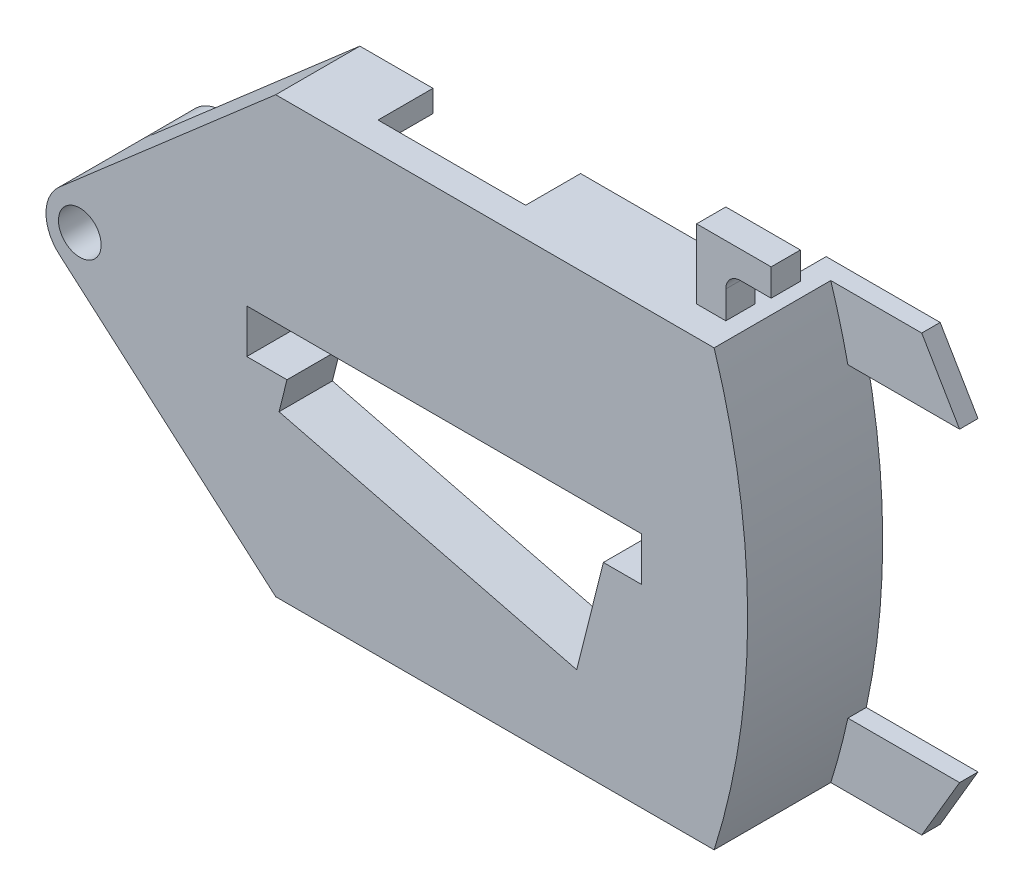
ISO-10303-21;
HEADER;
FILE_DESCRIPTION(('STEP AP214'),'2;1');
FILE_NAME('part.step','',(''),(''),'','','');
FILE_SCHEMA(('AUTOMOTIVE_DESIGN { 1 0 10303 214 1 1 1 1 }'));
ENDSEC;
DATA;
#1=APPLICATION_CONTEXT('core data for automotive mechanical design processes');
#2=APPLICATION_PROTOCOL_DEFINITION('international standard','automotive_design',2000,#1);
#3=PRODUCT_CONTEXT('',#1,'mechanical');
#4=PRODUCT('Part','Part','',(#3));
#5=PRODUCT_RELATED_PRODUCT_CATEGORY('part','',(#4));
#6=PRODUCT_DEFINITION_FORMATION('','',#4);
#7=PRODUCT_DEFINITION_CONTEXT('part definition',#1,'design');
#8=PRODUCT_DEFINITION('design','',#6,#7);
#9=PRODUCT_DEFINITION_SHAPE('','',#8);
#10=(LENGTH_UNIT() NAMED_UNIT(*) SI_UNIT(.MILLI.,.METRE.));
#11=(NAMED_UNIT(*) PLANE_ANGLE_UNIT() SI_UNIT($,.RADIAN.));
#12=(NAMED_UNIT(*) SI_UNIT($,.STERADIAN.) SOLID_ANGLE_UNIT());
#13=UNCERTAINTY_MEASURE_WITH_UNIT(LENGTH_MEASURE(1.E-05),#10,'distance_accuracy_value','');
#14=(GEOMETRIC_REPRESENTATION_CONTEXT(3) GLOBAL_UNCERTAINTY_ASSIGNED_CONTEXT((#13)) GLOBAL_UNIT_ASSIGNED_CONTEXT((#10,
#11,#12)) REPRESENTATION_CONTEXT('',''));
#15=CARTESIAN_POINT('',(0.,0.,0.));
#16=DIRECTION('',(0.,0.,1.));
#17=DIRECTION('',(1.,0.,0.));
#18=AXIS2_PLACEMENT_3D('',#15,#16,#17);
#19=CARTESIAN_POINT('',(0.,0.,5.76));
#20=DIRECTION('',(0.,0.,-1.));
#21=DIRECTION('',(-1.,0.,0.));
#22=AXIS2_PLACEMENT_3D('',#19,#20,#21);
#23=CYLINDRICAL_SURFACE('',#22,49.4);
#24=CARTESIAN_POINT('',(0.,0.,-3.48000000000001));
#25=DIRECTION('',(0.,0.,-1.));
#26=DIRECTION('',(-1.,0.,0.));
#27=AXIS2_PLACEMENT_3D('',#24,#25,#26);
#28=CIRCLE('',#27,49.4);
#29=CARTESIAN_POINT('',(48.2776174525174,10.4705135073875,-3.48000000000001));
#30=VERTEX_POINT('',#29);
#31=CARTESIAN_POINT('',(48.2776174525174,-10.4705135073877,-3.48000000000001));
#32=VERTEX_POINT('',#31);
#33=EDGE_CURVE('E581',#30,#32,#28,.T.);
#34=ORIENTED_EDGE('',*,*,#33,.F.);
#35=DIRECTION('',(0.,0.,-1.));
#36=VECTOR('',#35,1.);
#37=CARTESIAN_POINT('',(48.2776174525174,10.4705135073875,5.76));
#38=LINE('',#37,#36);
#39=CARTESIAN_POINT('',(48.2776174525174,10.4705135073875,-2.22));
#40=VERTEX_POINT('',#39);
#41=EDGE_CURVE('E1075',#30,#40,#38,.F.);
#42=ORIENTED_EDGE('',*,*,#41,.T.);
#43=CARTESIAN_POINT('',(0.,0.,-2.22));
#44=DIRECTION('',(0.,0.,-1.));
#45=DIRECTION('',(-1.,0.,0.));
#46=AXIS2_PLACEMENT_3D('',#43,#44,#45);
#47=CIRCLE('',#46,49.4);
#48=CARTESIAN_POINT('',(47.1072645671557,14.8749999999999,-2.22));
#49=VERTEX_POINT('',#48);
#50=EDGE_CURVE('E591',#49,#40,#47,.T.);
#51=ORIENTED_EDGE('',*,*,#50,.F.);
#52=DIRECTION('',(0.,0.,-1.));
#53=VECTOR('',#52,1.);
#54=CARTESIAN_POINT('',(47.1072645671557,14.8749999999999,5.76));
#55=LINE('',#54,#53);
#56=CARTESIAN_POINT('',(47.1072645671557,14.8749999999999,5.76));
#57=VERTEX_POINT('',#56);
#58=EDGE_CURVE('E935',#57,#49,#55,.T.);
#59=ORIENTED_EDGE('',*,*,#58,.F.);
#60=CARTESIAN_POINT('',(0.,0.,5.76));
#61=DIRECTION('',(0.,0.,1.));
#62=DIRECTION('',(1.,0.,0.));
#63=AXIS2_PLACEMENT_3D('',#60,#61,#62);
#64=CIRCLE('',#63,49.4);
#65=CARTESIAN_POINT('',(47.1072645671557,-14.8750000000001,5.76));
#66=VERTEX_POINT('',#65);
#67=EDGE_CURVE('E926',#66,#57,#64,.T.);
#68=ORIENTED_EDGE('',*,*,#67,.F.);
#69=DIRECTION('',(0.,0.,-1.));
#70=VECTOR('',#69,1.);
#71=CARTESIAN_POINT('',(47.1072645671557,-14.8750000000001,5.76));
#72=LINE('',#71,#70);
#73=CARTESIAN_POINT('',(47.1072645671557,-14.8750000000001,-2.22));
#74=VERTEX_POINT('',#73);
#75=EDGE_CURVE('E937',#66,#74,#72,.T.);
#76=ORIENTED_EDGE('',*,*,#75,.T.);
#77=CARTESIAN_POINT('',(0.,0.,-2.22));
#78=DIRECTION('',(0.,0.,-1.));
#79=DIRECTION('',(-1.,0.,0.));
#80=AXIS2_PLACEMENT_3D('',#77,#78,#79);
#81=CIRCLE('',#80,49.4);
#82=CARTESIAN_POINT('',(48.2776174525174,-10.4705135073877,-2.22));
#83=VERTEX_POINT('',#82);
#84=EDGE_CURVE('E599',#83,#74,#81,.T.);
#85=ORIENTED_EDGE('',*,*,#84,.F.);
#86=DIRECTION('',(0.,0.,-1.));
#87=VECTOR('',#86,1.);
#88=CARTESIAN_POINT('',(48.2776174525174,-10.4705135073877,5.76));
#89=LINE('',#88,#87);
#90=EDGE_CURVE('E596',#32,#83,#89,.F.);
#91=ORIENTED_EDGE('',*,*,#90,.F.);
#92=EDGE_LOOP('',(#34,#42,#51,#59,#68,#76,#85,#91));
#93=FACE_BOUND('',#92,.T.);
#94=ADVANCED_FACE('F36',(#93),#23,.T.);
#95=CARTESIAN_POINT('',(0.,0.,0.));
#96=DIRECTION('',(0.,0.,1.));
#97=DIRECTION('',(1.,0.,0.));
#98=AXIS2_PLACEMENT_3D('',#95,#96,#97);
#99=PLANE('',#98);
#100=DIRECTION('',(0.,1.,0.));
#101=VECTOR('',#100,1.);
#102=CARTESIAN_POINT('',(38.431011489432,-1.81170183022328E-13,0.));
#103=LINE('',#102,#101);
#104=CARTESIAN_POINT('',(38.431011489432,-14.875,0.));
#105=VERTEX_POINT('',#104);
#106=CARTESIAN_POINT('',(38.431011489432,-13.375,0.));
#107=VERTEX_POINT('',#106);
#108=EDGE_CURVE('E642',#105,#107,#103,.T.);
#109=ORIENTED_EDGE('',*,*,#108,.F.);
#110=DIRECTION('',(1.,0.,0.));
#111=VECTOR('',#110,1.);
#112=CARTESIAN_POINT('',(17.1072645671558,-14.875,0.));
#113=LINE('',#112,#111);
#114=CARTESIAN_POINT('',(32.2072645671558,-14.875,0.));
#115=VERTEX_POINT('',#114);
#116=EDGE_CURVE('E912',#115,#105,#113,.T.);
#117=ORIENTED_EDGE('',*,*,#116,.F.);
#118=DIRECTION('',(0.,-1.,0.));
#119=VECTOR('',#118,1.);
#120=CARTESIAN_POINT('',(32.2072645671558,-3.14111022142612,0.));
#121=LINE('',#120,#119);
#122=CARTESIAN_POINT('',(32.2072645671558,-13.375,0.));
#123=VERTEX_POINT('',#122);
#124=EDGE_CURVE('E667',#123,#115,#121,.T.);
#125=ORIENTED_EDGE('',*,*,#124,.F.);
#126=DIRECTION('',(1.,0.,0.));
#127=VECTOR('',#126,1.);
#128=CARTESIAN_POINT('',(17.6682020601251,-13.375,0.));
#129=LINE('',#128,#127);
#130=EDGE_CURVE('E819',#123,#107,#129,.T.);
#131=ORIENTED_EDGE('',*,*,#130,.T.);
#132=EDGE_LOOP('',(#109,#117,#125,#131));
#133=FACE_BOUND('',#132,.T.);
#134=ADVANCED_FACE('F544',(#133),#99,.F.);
#135=DIRECTION('',(1.,0.,0.));
#136=VECTOR('',#135,1.);
#137=CARTESIAN_POINT('',(17.1072645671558,14.875,0.));
#138=LINE('',#137,#136);
#139=CARTESIAN_POINT('',(32.2072645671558,14.8749999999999,0.));
#140=VERTEX_POINT('',#139);
#141=CARTESIAN_POINT('',(45.5317952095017,14.8749999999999,0.));
#142=VERTEX_POINT('',#141);
#143=EDGE_CURVE('E916',#140,#142,#138,.T.);
#144=ORIENTED_EDGE('',*,*,#143,.T.);
#145=CARTESIAN_POINT('',(0.,0.,0.));
#146=DIRECTION('',(0.,0.,-1.));
#147=DIRECTION('',(-1.,0.,0.));
#148=AXIS2_PLACEMENT_3D('',#145,#146,#147);
#149=CIRCLE('',#148,47.9);
#150=CARTESIAN_POINT('',(45.9947755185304,13.3749999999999,0.));
#151=VERTEX_POINT('',#150);
#152=EDGE_CURVE('E606',#142,#151,#149,.T.);
#153=ORIENTED_EDGE('',*,*,#152,.T.);
#154=DIRECTION('',(1.,0.,0.));
#155=VECTOR('',#154,1.);
#156=CARTESIAN_POINT('',(17.6682020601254,13.375,0.));
#157=LINE('',#156,#155);
#158=CARTESIAN_POINT('',(32.2072645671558,13.375,0.));
#159=VERTEX_POINT('',#158);
#160=EDGE_CURVE('E810',#159,#151,#157,.T.);
#161=ORIENTED_EDGE('',*,*,#160,.F.);
#162=DIRECTION('',(0.,1.,0.));
#163=VECTOR('',#162,1.);
#164=CARTESIAN_POINT('',(32.2072645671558,2.59782040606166,0.));
#165=LINE('',#164,#163);
#166=EDGE_CURVE('E710',#159,#140,#165,.T.);
#167=ORIENTED_EDGE('',*,*,#166,.T.);
#168=EDGE_LOOP('',(#144,#153,#161,#167));
#169=FACE_BOUND('',#168,.T.);
#170=ADVANCED_FACE('F550',(#169),#99,.F.);
#171=CARTESIAN_POINT('',(17.6682020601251,-13.375,56.2438986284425));
#172=DIRECTION('',(0.,1.,0.));
#173=DIRECTION('',(-1.,0.,0.));
#174=AXIS2_PLACEMENT_3D('',#171,#172,#173);
#175=PLANE('',#174);
#176=DIRECTION('',(1.,0.,0.));
#177=VECTOR('',#176,1.);
#178=CARTESIAN_POINT('',(17.6682020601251,-13.375,3.75999999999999));
#179=LINE('',#178,#177);
#180=CARTESIAN_POINT('',(18.3782020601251,-13.375,3.75999999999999));
#181=VERTEX_POINT('',#180);
#182=CARTESIAN_POINT('',(38.431011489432,-13.375,3.75999999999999));
#183=VERTEX_POINT('',#182);
#184=EDGE_CURVE('E811',#181,#183,#179,.T.);
#185=ORIENTED_EDGE('',*,*,#184,.T.);
#186=DIRECTION('',(0.,0.,-1.));
#187=VECTOR('',#186,1.);
#188=CARTESIAN_POINT('',(38.431011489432,-13.375,56.2438986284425));
#189=LINE('',#188,#187);
#190=EDGE_CURVE('E640',#183,#107,#189,.T.);
#191=ORIENTED_EDGE('',*,*,#190,.T.);
#192=ORIENTED_EDGE('',*,*,#130,.F.);
#193=DIRECTION('',(0.,0.,-1.));
#194=VECTOR('',#193,1.);
#195=CARTESIAN_POINT('',(32.2072645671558,-13.375,1.64999999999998));
#196=LINE('',#195,#194);
#197=CARTESIAN_POINT('',(32.2072645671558,-13.375,1.64999999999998));
#198=VERTEX_POINT('',#197);
#199=EDGE_CURVE('E675',#198,#123,#196,.T.);
#200=ORIENTED_EDGE('',*,*,#199,.F.);
#201=DIRECTION('',(-1.,0.,0.));
#202=VECTOR('',#201,1.);
#203=CARTESIAN_POINT('',(32.2072645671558,-13.375,1.64999999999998));
#204=LINE('',#203,#202);
#205=CARTESIAN_POINT('',(22.107264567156,-13.375,1.65000000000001));
#206=VERTEX_POINT('',#205);
#207=EDGE_CURVE('E679',#198,#206,#204,.T.);
#208=ORIENTED_EDGE('',*,*,#207,.T.);
#209=DIRECTION('',(0.,0.,1.));
#210=VECTOR('',#209,1.);
#211=CARTESIAN_POINT('',(22.107264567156,-13.375,0.));
#212=LINE('',#211,#210);
#213=CARTESIAN_POINT('',(22.107264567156,-13.375,0.));
#214=VERTEX_POINT('',#213);
#215=EDGE_CURVE('E684',#214,#206,#212,.T.);
#216=ORIENTED_EDGE('',*,*,#215,.F.);
#217=CARTESIAN_POINT('',(18.3782020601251,-13.375,0.));
#218=VERTEX_POINT('',#217);
#219=EDGE_CURVE('E816',#218,#214,#129,.T.);
#220=ORIENTED_EDGE('',*,*,#219,.F.);
#221=DIRECTION('',(0.,0.,1.));
#222=VECTOR('',#221,1.);
#223=CARTESIAN_POINT('',(18.3782020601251,-13.375,-4.50941237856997));
#224=LINE('',#223,#222);
#225=EDGE_CURVE('E661',#218,#181,#224,.T.);
#226=ORIENTED_EDGE('',*,*,#225,.T.);
#227=EDGE_LOOP('',(#185,#191,#192,#200,#208,#216,#220,#226));
#228=FACE_BOUND('',#227,.T.);
#229=ADVANCED_FACE('F1118',(#228),#175,.T.);
#230=DIRECTION('',(0.,0.,-1.));
#231=VECTOR('',#230,1.);
#232=CARTESIAN_POINT('',(45.9947755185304,-13.375,56.2438986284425));
#233=LINE('',#232,#231);
#234=CARTESIAN_POINT('',(45.9947755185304,-13.375,3.75999999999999));
#235=VERTEX_POINT('',#234);
#236=CARTESIAN_POINT('',(45.9947755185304,-13.375,-1.42));
#237=VERTEX_POINT('',#236);
#238=EDGE_CURVE('E837',#235,#237,#233,.T.);
#239=ORIENTED_EDGE('',*,*,#238,.T.);
#240=DIRECTION('',(1.,0.,0.));
#241=VECTOR('',#240,1.);
#242=CARTESIAN_POINT('',(39.801011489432,-13.3750000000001,-1.42));
#243=LINE('',#242,#241);
#244=CARTESIAN_POINT('',(39.801011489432,-13.3750000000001,-1.42));
#245=VERTEX_POINT('',#244);
#246=EDGE_CURVE('E629',#245,#237,#243,.T.);
#247=ORIENTED_EDGE('',*,*,#246,.F.);
#248=DIRECTION('',(0.,0.,1.));
#249=VECTOR('',#248,1.);
#250=CARTESIAN_POINT('',(39.801011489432,-13.3750000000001,-1.42));
#251=LINE('',#250,#249);
#252=CARTESIAN_POINT('',(39.801011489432,-13.3750000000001,3.75999999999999));
#253=VERTEX_POINT('',#252);
#254=EDGE_CURVE('E637',#245,#253,#251,.T.);
#255=ORIENTED_EDGE('',*,*,#254,.T.);
#256=EDGE_CURVE('E831',#253,#235,#179,.T.);
#257=ORIENTED_EDGE('',*,*,#256,.T.);
#258=EDGE_LOOP('',(#239,#247,#255,#257));
#259=FACE_BOUND('',#258,.T.);
#260=ADVANCED_FACE('F1039',(#259),#175,.T.);
#261=CARTESIAN_POINT('',(0.,0.,3.75999999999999));
#262=DIRECTION('',(0.,0.,1.));
#263=DIRECTION('',(1.,0.,0.));
#264=AXIS2_PLACEMENT_3D('',#261,#262,#263);
#265=PLANE('',#264);
#266=DIRECTION('',(0.243197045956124,0.969976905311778,0.));
#267=VECTOR('',#266,1.);
#268=CARTESIAN_POINT('',(38.431011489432,-10.1180007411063,3.75999999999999));
#269=LINE('',#268,#267);
#270=CARTESIAN_POINT('',(38.431011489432,-10.1180007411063,3.75999999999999));
#271=VERTEX_POINT('',#270);
#272=CARTESIAN_POINT('',(40.3084372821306,-2.63000000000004,3.75999999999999));
#273=VERTEX_POINT('',#272);
#274=EDGE_CURVE('E762',#271,#273,#269,.T.);
#275=ORIENTED_EDGE('',*,*,#274,.T.);
#276=DIRECTION('',(1.,0.,0.));
#277=VECTOR('',#276,1.);
#278=CARTESIAN_POINT('',(40.3084372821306,-2.63000000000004,3.75999999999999));
#279=LINE('',#278,#277);
#280=CARTESIAN_POINT('',(43.1282094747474,-2.63000000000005,3.75999999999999));
#281=VERTEX_POINT('',#280);
#282=EDGE_CURVE('E741',#273,#281,#279,.T.);
#283=ORIENTED_EDGE('',*,*,#282,.T.);
#284=DIRECTION('',(0.,1.,0.));
#285=VECTOR('',#284,1.);
#286=CARTESIAN_POINT('',(43.1282094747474,-2.63000000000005,3.75999999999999));
#287=LINE('',#286,#285);
#288=CARTESIAN_POINT('',(43.1282094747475,2.36999999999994,3.75999999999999));
#289=VERTEX_POINT('',#288);
#290=EDGE_CURVE('E744',#281,#289,#287,.T.);
#291=ORIENTED_EDGE('',*,*,#290,.T.);
#292=DIRECTION('',(-1.,0.,0.));
#293=VECTOR('',#292,1.);
#294=CARTESIAN_POINT('',(43.1282094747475,2.36999999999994,3.75999999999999));
#295=LINE('',#294,#293);
#296=CARTESIAN_POINT('',(14.1282094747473,2.36999999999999,3.75999999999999));
#297=VERTEX_POINT('',#296);
#298=EDGE_CURVE('E747',#289,#297,#295,.T.);
#299=ORIENTED_EDGE('',*,*,#298,.T.);
#300=DIRECTION('',(0.,-1.,0.));
#301=VECTOR('',#300,1.);
#302=CARTESIAN_POINT('',(14.1282094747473,2.36999999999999,3.75999999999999));
#303=LINE('',#302,#301);
#304=CARTESIAN_POINT('',(14.1282094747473,-2.63000000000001,3.75999999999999));
#305=VERTEX_POINT('',#304);
#306=EDGE_CURVE('E750',#297,#305,#303,.T.);
#307=ORIENTED_EDGE('',*,*,#306,.T.);
#308=DIRECTION('',(1.,0.,0.));
#309=VECTOR('',#308,1.);
#310=CARTESIAN_POINT('',(14.1282094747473,-2.63000000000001,3.75999999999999));
#311=LINE('',#310,#309);
#312=CARTESIAN_POINT('',(16.596532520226,-2.63000000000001,3.75999999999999));
#313=VERTEX_POINT('',#312);
#314=EDGE_CURVE('E753',#305,#313,#311,.T.);
#315=ORIENTED_EDGE('',*,*,#314,.T.);
#316=DIRECTION('',(-0.243197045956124,-0.969976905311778,0.));
#317=VECTOR('',#316,1.);
#318=CARTESIAN_POINT('',(16.596532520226,-2.63000000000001,3.75999999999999));
#319=LINE('',#318,#317);
#320=CARTESIAN_POINT('',(16.1215426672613,-4.52446868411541,3.75999999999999));
#321=VERTEX_POINT('',#320);
#322=EDGE_CURVE('E756',#313,#321,#319,.T.);
#323=ORIENTED_EDGE('',*,*,#322,.T.);
#324=DIRECTION('',(0.969976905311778,-0.243197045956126,0.));
#325=VECTOR('',#324,1.);
#326=CARTESIAN_POINT('',(16.1215426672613,-4.52446868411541,3.75999999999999));
#327=LINE('',#326,#325);
#328=EDGE_CURVE('E759',#321,#271,#327,.T.);
#329=ORIENTED_EDGE('',*,*,#328,.T.);
#330=EDGE_LOOP('',(#275,#283,#291,#299,#307,#315,#323,#329));
#331=FACE_BOUND('',#330,.T.);
#332=DIRECTION('',(0.,1.,0.));
#333=VECTOR('',#332,1.);
#334=CARTESIAN_POINT('',(38.431011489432,-14.875,3.75999999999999));
#335=LINE('',#334,#333);
#336=CARTESIAN_POINT('',(38.431011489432,-11.36,3.75999999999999));
#337=VERTEX_POINT('',#336);
#338=EDGE_CURVE('E620',#183,#337,#335,.T.);
#339=ORIENTED_EDGE('',*,*,#338,.F.);
#340=ORIENTED_EDGE('',*,*,#184,.F.);
#341=DIRECTION('',(0.,1.,0.));
#342=VECTOR('',#341,1.);
#343=CARTESIAN_POINT('',(18.3782020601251,-13.375,3.75999999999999));
#344=LINE('',#343,#342);
#345=CARTESIAN_POINT('',(18.3782020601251,-9.795,3.75999999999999));
#346=VERTEX_POINT('',#345);
#347=EDGE_CURVE('E645',#181,#346,#344,.T.);
#348=ORIENTED_EDGE('',*,*,#347,.T.);
#349=CARTESIAN_POINT('',(17.6782020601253,-9.79500000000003,3.75999999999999));
#350=DIRECTION('',(0.,0.,1.));
#351=DIRECTION('',(1.,0.,0.));
#352=AXIS2_PLACEMENT_3D('',#349,#350,#351);
#353=CIRCLE('',#352,0.7);
#354=CARTESIAN_POINT('',(17.6782020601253,-9.09499999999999,3.75999999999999));
#355=VERTEX_POINT('',#354);
#356=EDGE_CURVE('E993',#346,#355,#353,.T.);
#357=ORIENTED_EDGE('',*,*,#356,.T.);
#358=DIRECTION('',(-1.,0.,0.));
#359=VECTOR('',#358,1.);
#360=CARTESIAN_POINT('',(18.3782020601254,-9.09500000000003,3.75999999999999));
#361=LINE('',#360,#359);
#362=CARTESIAN_POINT('',(17.6582020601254,-9.09500000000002,3.75999999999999));
#363=VERTEX_POINT('',#362);
#364=EDGE_CURVE('E656',#355,#363,#361,.T.);
#365=ORIENTED_EDGE('',*,*,#364,.T.);
#366=CARTESIAN_POINT('',(17.6582020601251,-9.79500000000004,3.75999999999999));
#367=DIRECTION('',(0.,0.,1.));
#368=DIRECTION('',(1.,0.,0.));
#369=AXIS2_PLACEMENT_3D('',#366,#367,#368);
#370=CIRCLE('',#369,0.7);
#371=CARTESIAN_POINT('',(16.9582020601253,-9.79500000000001,3.75999999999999));
#372=VERTEX_POINT('',#371);
#373=EDGE_CURVE('E995',#363,#372,#370,.T.);
#374=ORIENTED_EDGE('',*,*,#373,.T.);
#375=DIRECTION('',(0.,-1.,0.));
#376=VECTOR('',#375,1.);
#377=CARTESIAN_POINT('',(16.9582020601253,-9.09500000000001,3.75999999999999));
#378=LINE('',#377,#376);
#379=CARTESIAN_POINT('',(16.9582020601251,-12.7576453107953,3.75999999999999));
#380=VERTEX_POINT('',#379);
#381=EDGE_CURVE('E659',#372,#380,#378,.T.);
#382=ORIENTED_EDGE('',*,*,#381,.T.);
#383=DIRECTION('',(0.754624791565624,-0.656156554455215,0.));
#384=VECTOR('',#383,1.);
#385=CARTESIAN_POINT('',(5.08573227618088,-2.4343708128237,3.75999999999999));
#386=LINE('',#385,#384);
#387=CARTESIAN_POINT('',(5.08573227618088,-2.4343708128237,3.75999999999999));
#388=VERTEX_POINT('',#387);
#389=EDGE_CURVE('E828',#388,#380,#386,.T.);
#390=ORIENTED_EDGE('',*,*,#389,.F.);
#391=CARTESIAN_POINT('',(4.03867031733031,0.,3.75999999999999));
#392=DIRECTION('',(0.,0.,1.));
#393=DIRECTION('',(1.,0.,0.));
#394=AXIS2_PLACEMENT_3D('',#391,#392,#393);
#395=CIRCLE('',#394,2.65);
#396=CARTESIAN_POINT('',(5.08573227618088,2.4343708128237,3.75999999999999));
#397=VERTEX_POINT('',#396);
#398=EDGE_CURVE('E792',#397,#388,#395,.F.);
#399=ORIENTED_EDGE('',*,*,#398,.F.);
#400=DIRECTION('',(0.75462479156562,0.656156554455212,0.));
#401=VECTOR('',#400,1.);
#402=CARTESIAN_POINT('',(5.08573227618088,2.4343708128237,3.75999999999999));
#403=LINE('',#402,#401);
#404=CARTESIAN_POINT('',(17.6682020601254,13.375,3.76000000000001));
#405=VERTEX_POINT('',#404);
#406=EDGE_CURVE('E815',#397,#405,#403,.T.);
#407=ORIENTED_EDGE('',*,*,#406,.T.);
#408=DIRECTION('',(1.,0.,0.));
#409=VECTOR('',#408,1.);
#410=CARTESIAN_POINT('',(17.6682020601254,13.375,3.76000000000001));
#411=LINE('',#410,#409);
#412=CARTESIAN_POINT('',(22.1072645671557,13.375,3.75999999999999));
#413=VERTEX_POINT('',#412);
#414=EDGE_CURVE('E839',#405,#413,#411,.T.);
#415=ORIENTED_EDGE('',*,*,#414,.T.);
#416=DIRECTION('',(0.,1.,0.));
#417=VECTOR('',#416,1.);
#418=CARTESIAN_POINT('',(22.107264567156,2.59782040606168,3.76000000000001));
#419=LINE('',#418,#417);
#420=CARTESIAN_POINT('',(22.107264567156,14.8749999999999,3.76000000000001));
#421=VERTEX_POINT('',#420);
#422=EDGE_CURVE('E715',#413,#421,#419,.T.);
#423=ORIENTED_EDGE('',*,*,#422,.T.);
#424=DIRECTION('',(1.,0.,0.));
#425=VECTOR('',#424,1.);
#426=CARTESIAN_POINT('',(22.107264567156,14.8749999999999,3.76000000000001));
#427=LINE('',#426,#425);
#428=CARTESIAN_POINT('',(32.2072645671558,14.8749999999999,3.76000000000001));
#429=VERTEX_POINT('',#428);
#430=EDGE_CURVE('E704',#421,#429,#427,.T.);
#431=ORIENTED_EDGE('',*,*,#430,.T.);
#432=DIRECTION('',(0.,1.,0.));
#433=VECTOR('',#432,1.);
#434=CARTESIAN_POINT('',(32.2072645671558,2.59782040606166,3.76000000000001));
#435=LINE('',#434,#433);
#436=CARTESIAN_POINT('',(32.2072645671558,13.375,3.76000000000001));
#437=VERTEX_POINT('',#436);
#438=EDGE_CURVE('E698',#437,#429,#435,.T.);
#439=ORIENTED_EDGE('',*,*,#438,.F.);
#440=CARTESIAN_POINT('',(45.9947755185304,13.3749999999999,3.75999999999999));
#441=VERTEX_POINT('',#440);
#442=EDGE_CURVE('E842',#437,#441,#411,.T.);
#443=ORIENTED_EDGE('',*,*,#442,.T.);
#444=CARTESIAN_POINT('',(0.,0.,3.75999999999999));
#445=DIRECTION('',(0.,0.,1.));
#446=DIRECTION('',(1.,0.,0.));
#447=AXIS2_PLACEMENT_3D('',#444,#445,#446);
#448=CIRCLE('',#447,47.9);
#449=EDGE_CURVE('E834',#441,#235,#448,.F.);
#450=ORIENTED_EDGE('',*,*,#449,.T.);
#451=ORIENTED_EDGE('',*,*,#256,.F.);
#452=DIRECTION('',(0.,-1.,0.));
#453=VECTOR('',#452,1.);
#454=CARTESIAN_POINT('',(39.801011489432,-10.6750000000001,3.75999999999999));
#455=LINE('',#454,#453);
#456=CARTESIAN_POINT('',(39.801011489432,-11.36,3.75999999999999));
#457=VERTEX_POINT('',#456);
#458=EDGE_CURVE('E619',#457,#253,#455,.T.);
#459=ORIENTED_EDGE('',*,*,#458,.F.);
#460=CARTESIAN_POINT('',(39.116011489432,-11.36,3.75999999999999));
#461=DIRECTION('',(0.,0.,1.));
#462=DIRECTION('',(1.,0.,0.));
#463=AXIS2_PLACEMENT_3D('',#460,#461,#462);
#464=CIRCLE('',#463,0.685);
#465=CARTESIAN_POINT('',(39.116011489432,-10.675,3.75999999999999));
#466=VERTEX_POINT('',#465);
#467=EDGE_CURVE('E1006',#457,#466,#464,.T.);
#468=ORIENTED_EDGE('',*,*,#467,.T.);
#469=CARTESIAN_POINT('',(39.116011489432,-11.36,3.75999999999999));
#470=DIRECTION('',(0.,0.,1.));
#471=DIRECTION('',(1.,0.,0.));
#472=AXIS2_PLACEMENT_3D('',#469,#470,#471);
#473=CIRCLE('',#472,0.685);
#474=EDGE_CURVE('E1008',#466,#337,#473,.T.);
#475=ORIENTED_EDGE('',*,*,#474,.T.);
#476=EDGE_LOOP('',(#339,#340,#348,#357,#365,#374,#382,#390,#399,#407,#415,#423,#431,#439,#443,
#450,#451,#459,#468,#475));
#477=FACE_BOUND('',#476,.T.);
#478=ADVANCED_FACE('F566',(#331,#477),#265,.F.);
#479=DIRECTION('',(1.,0.,0.));
#480=VECTOR('',#479,1.);
#481=CARTESIAN_POINT('',(18.3782020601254,-9.09500000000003,0.));
#482=LINE('',#481,#480);
#483=CARTESIAN_POINT('',(17.6582020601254,-9.09500000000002,0.));
#484=VERTEX_POINT('',#483);
#485=CARTESIAN_POINT('',(17.6782020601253,-9.09499999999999,0.));
#486=VERTEX_POINT('',#485);
#487=EDGE_CURVE('E646',#484,#486,#482,.T.);
#488=ORIENTED_EDGE('',*,*,#487,.T.);
#489=CARTESIAN_POINT('',(17.6782020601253,-9.79500000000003,0.));
#490=DIRECTION('',(0.,0.,1.));
#491=DIRECTION('',(1.,0.,0.));
#492=AXIS2_PLACEMENT_3D('',#489,#490,#491);
#493=CIRCLE('',#492,0.7);
#494=CARTESIAN_POINT('',(18.3782020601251,-9.795,0.));
#495=VERTEX_POINT('',#494);
#496=EDGE_CURVE('E989',#486,#495,#493,.F.);
#497=ORIENTED_EDGE('',*,*,#496,.T.);
#498=DIRECTION('',(0.,-1.,0.));
#499=VECTOR('',#498,1.);
#500=CARTESIAN_POINT('',(18.3782020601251,-13.375,0.));
#501=LINE('',#500,#499);
#502=EDGE_CURVE('E653',#495,#218,#501,.T.);
#503=ORIENTED_EDGE('',*,*,#502,.T.);
#504=ORIENTED_EDGE('',*,*,#219,.T.);
#505=DIRECTION('',(0.,-1.,0.));
#506=VECTOR('',#505,1.);
#507=CARTESIAN_POINT('',(22.1072645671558,-3.1411102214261,0.));
#508=LINE('',#507,#506);
#509=CARTESIAN_POINT('',(22.1072645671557,-14.875,0.));
#510=VERTEX_POINT('',#509);
#511=EDGE_CURVE('E680',#214,#510,#508,.T.);
#512=ORIENTED_EDGE('',*,*,#511,.T.);
#513=CARTESIAN_POINT('',(17.1072645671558,-14.875,0.));
#514=VERTEX_POINT('',#513);
#515=EDGE_CURVE('E913',#514,#510,#113,.T.);
#516=ORIENTED_EDGE('',*,*,#515,.F.);
#517=DIRECTION('',(0.754624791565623,-0.656156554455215,0.));
#518=VECTOR('',#517,1.);
#519=CARTESIAN_POINT('',(0.,0.,0.));
#520=LINE('',#519,#518);
#521=CARTESIAN_POINT('',(2.29985544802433,-1.99975569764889,0.));
#522=VERTEX_POINT('',#521);
#523=EDGE_CURVE('E910',#522,#514,#520,.T.);
#524=ORIENTED_EDGE('',*,*,#523,.F.);
#525=CARTESIAN_POINT('',(4.03867031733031,0.,0.));
#526=DIRECTION('',(0.,0.,1.));
#527=DIRECTION('',(1.,0.,0.));
#528=AXIS2_PLACEMENT_3D('',#525,#526,#527);
#529=CIRCLE('',#528,2.65);
#530=CARTESIAN_POINT('',(5.08573227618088,-2.4343708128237,0.));
#531=VERTEX_POINT('',#530);
#532=EDGE_CURVE('E944',#522,#531,#529,.T.);
#533=ORIENTED_EDGE('',*,*,#532,.T.);
#534=DIRECTION('',(0.754624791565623,-0.656156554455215,0.));
#535=VECTOR('',#534,1.);
#536=CARTESIAN_POINT('',(5.08573227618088,-2.4343708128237,0.));
#537=LINE('',#536,#535);
#538=CARTESIAN_POINT('',(16.9582020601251,-12.7576453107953,0.));
#539=VERTEX_POINT('',#538);
#540=EDGE_CURVE('E820',#531,#539,#537,.T.);
#541=ORIENTED_EDGE('',*,*,#540,.T.);
#542=DIRECTION('',(0.,1.,0.));
#543=VECTOR('',#542,1.);
#544=CARTESIAN_POINT('',(16.9582020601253,-9.09500000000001,0.));
#545=LINE('',#544,#543);
#546=CARTESIAN_POINT('',(16.9582020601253,-9.79500000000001,0.));
#547=VERTEX_POINT('',#546);
#548=EDGE_CURVE('E649',#539,#547,#545,.T.);
#549=ORIENTED_EDGE('',*,*,#548,.T.);
#550=CARTESIAN_POINT('',(17.6582020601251,-9.79500000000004,0.));
#551=DIRECTION('',(0.,0.,1.));
#552=DIRECTION('',(1.,0.,0.));
#553=AXIS2_PLACEMENT_3D('',#550,#551,#552);
#554=CIRCLE('',#553,0.7);
#555=EDGE_CURVE('E987',#547,#484,#554,.F.);
#556=ORIENTED_EDGE('',*,*,#555,.T.);
#557=EDGE_LOOP('',(#488,#497,#503,#504,#512,#516,#524,#533,#541,#549,#556));
#558=FACE_BOUND('',#557,.T.);
#559=ADVANCED_FACE('F553',(#558),#99,.F.);
#560=CARTESIAN_POINT('',(17.1072645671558,-14.875,5.76));
#561=DIRECTION('',(0.,1.,0.));
#562=DIRECTION('',(-1.,0.,0.));
#563=AXIS2_PLACEMENT_3D('',#560,#561,#562);
#564=PLANE('',#563);
#565=DIRECTION('',(-1.,0.,0.));
#566=VECTOR('',#565,1.);
#567=CARTESIAN_POINT('',(47.1072645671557,-14.8750000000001,-3.48000000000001));
#568=LINE('',#567,#566);
#569=CARTESIAN_POINT('',(53.3317952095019,-14.875,-3.48000000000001));
#570=VERTEX_POINT('',#569);
#571=CARTESIAN_POINT('',(45.5317952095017,-14.875,-3.48000000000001));
#572=VERTEX_POINT('',#571);
#573=EDGE_CURVE('E571',#570,#572,#568,.T.);
#574=ORIENTED_EDGE('',*,*,#573,.F.);
#575=DIRECTION('',(0.,0.,-1.));
#576=VECTOR('',#575,1.);
#577=CARTESIAN_POINT('',(53.3317952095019,-14.875,-2.22));
#578=LINE('',#577,#576);
#579=CARTESIAN_POINT('',(53.3317952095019,-14.875,-2.22));
#580=VERTEX_POINT('',#579);
#581=EDGE_CURVE('E575',#580,#570,#578,.T.);
#582=ORIENTED_EDGE('',*,*,#581,.F.);
#583=DIRECTION('',(1.,0.,0.));
#584=VECTOR('',#583,1.);
#585=CARTESIAN_POINT('',(47.1072645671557,-14.8750000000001,-2.22));
#586=LINE('',#585,#584);
#587=EDGE_CURVE('E1081',#74,#580,#586,.T.);
#588=ORIENTED_EDGE('',*,*,#587,.F.);
#589=ORIENTED_EDGE('',*,*,#75,.F.);
#590=DIRECTION('',(1.,0.,0.));
#591=VECTOR('',#590,1.);
#592=CARTESIAN_POINT('',(17.1072645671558,-14.875,5.76));
#593=LINE('',#592,#591);
#594=CARTESIAN_POINT('',(17.1072645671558,-14.875,5.76));
#595=VERTEX_POINT('',#594);
#596=EDGE_CURVE('E924',#595,#66,#593,.T.);
#597=ORIENTED_EDGE('',*,*,#596,.F.);
#598=DIRECTION('',(0.,0.,-1.));
#599=VECTOR('',#598,1.);
#600=CARTESIAN_POINT('',(17.1072645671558,-14.875,5.76));
#601=LINE('',#600,#599);
#602=EDGE_CURVE('E940',#595,#514,#601,.T.);
#603=ORIENTED_EDGE('',*,*,#602,.T.);
#604=ORIENTED_EDGE('',*,*,#515,.T.);
#605=DIRECTION('',(0.,0.,1.));
#606=VECTOR('',#605,1.);
#607=CARTESIAN_POINT('',(22.1072645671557,-14.875,0.));
#608=LINE('',#607,#606);
#609=CARTESIAN_POINT('',(22.1072645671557,-14.875,1.65000000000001));
#610=VERTEX_POINT('',#609);
#611=EDGE_CURVE('E676',#510,#610,#608,.T.);
#612=ORIENTED_EDGE('',*,*,#611,.T.);
#613=DIRECTION('',(-1.,0.,0.));
#614=VECTOR('',#613,1.);
#615=CARTESIAN_POINT('',(32.2072645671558,-14.875,1.64999999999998));
#616=LINE('',#615,#614);
#617=CARTESIAN_POINT('',(32.2072645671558,-14.875,1.64999999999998));
#618=VERTEX_POINT('',#617);
#619=EDGE_CURVE('E671',#618,#610,#616,.T.);
#620=ORIENTED_EDGE('',*,*,#619,.F.);
#621=DIRECTION('',(0.,0.,-1.));
#622=VECTOR('',#621,1.);
#623=CARTESIAN_POINT('',(32.2072645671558,-14.875,1.64999999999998));
#624=LINE('',#623,#622);
#625=EDGE_CURVE('E668',#618,#115,#624,.T.);
#626=ORIENTED_EDGE('',*,*,#625,.T.);
#627=ORIENTED_EDGE('',*,*,#116,.T.);
#628=DIRECTION('',(0.,0.,1.));
#629=VECTOR('',#628,1.);
#630=CARTESIAN_POINT('',(38.431011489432,-14.875,-1.42));
#631=LINE('',#630,#629);
#632=CARTESIAN_POINT('',(38.431011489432,-14.875,-1.42));
#633=VERTEX_POINT('',#632);
#634=EDGE_CURVE('E634',#633,#105,#631,.T.);
#635=ORIENTED_EDGE('',*,*,#634,.F.);
#636=DIRECTION('',(-1.,0.,0.));
#637=VECTOR('',#636,1.);
#638=CARTESIAN_POINT('',(47.1072645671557,-14.8750000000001,-1.42));
#639=LINE('',#638,#637);
#640=CARTESIAN_POINT('',(45.5317952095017,-14.875,-1.42));
#641=VERTEX_POINT('',#640);
#642=EDGE_CURVE('E632',#641,#633,#639,.T.);
#643=ORIENTED_EDGE('',*,*,#642,.F.);
#644=DIRECTION('',(0.,0.,1.));
#645=VECTOR('',#644,1.);
#646=CARTESIAN_POINT('',(45.5317952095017,-14.875,-3.48000000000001));
#647=LINE('',#646,#645);
#648=EDGE_CURVE('E577',#572,#641,#647,.T.);
#649=ORIENTED_EDGE('',*,*,#648,.F.);
#650=EDGE_LOOP('',(#574,#582,#588,#589,#597,#603,#604,#612,#620,#626,#627,#635,#643,#649));
#651=FACE_BOUND('',#650,.T.);
#652=ADVANCED_FACE('F557',(#651),#564,.F.);
#653=DIRECTION('',(0.,1.,0.));
#654=VECTOR('',#653,1.);
#655=CARTESIAN_POINT('',(22.107264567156,2.59782040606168,0.));
#656=LINE('',#655,#654);
#657=CARTESIAN_POINT('',(22.1072645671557,13.375,0.));
#658=VERTEX_POINT('',#657);
#659=CARTESIAN_POINT('',(22.107264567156,14.8749999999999,0.));
#660=VERTEX_POINT('',#659);
#661=EDGE_CURVE('E713',#658,#660,#656,.T.);
#662=ORIENTED_EDGE('',*,*,#661,.F.);
#663=CARTESIAN_POINT('',(17.6682020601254,13.375,0.));
#664=VERTEX_POINT('',#663);
#665=EDGE_CURVE('E812',#664,#658,#157,.T.);
#666=ORIENTED_EDGE('',*,*,#665,.F.);
#667=DIRECTION('',(0.75462479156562,0.656156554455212,0.));
#668=VECTOR('',#667,1.);
#669=CARTESIAN_POINT('',(5.08573227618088,2.4343708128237,0.));
#670=LINE('',#669,#668);
#671=CARTESIAN_POINT('',(5.08573227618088,2.4343708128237,0.));
#672=VERTEX_POINT('',#671);
#673=EDGE_CURVE('E807',#672,#664,#670,.T.);
#674=ORIENTED_EDGE('',*,*,#673,.F.);
#675=CARTESIAN_POINT('',(2.29985544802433,1.9997556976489,0.));
#676=VERTEX_POINT('',#675);
#677=EDGE_CURVE('E943',#672,#676,#529,.T.);
#678=ORIENTED_EDGE('',*,*,#677,.T.);
#679=DIRECTION('',(0.754624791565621,0.656156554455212,0.));
#680=VECTOR('',#679,1.);
#681=CARTESIAN_POINT('',(0.,0.,0.));
#682=LINE('',#681,#680);
#683=CARTESIAN_POINT('',(17.1072645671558,14.875,0.));
#684=VERTEX_POINT('',#683);
#685=EDGE_CURVE('E920',#676,#684,#682,.T.);
#686=ORIENTED_EDGE('',*,*,#685,.T.);
#687=EDGE_CURVE('E917',#684,#660,#138,.T.);
#688=ORIENTED_EDGE('',*,*,#687,.T.);
#689=EDGE_LOOP('',(#662,#666,#674,#678,#686,#688));
#690=FACE_BOUND('',#689,.T.);
#691=ADVANCED_FACE('F559',(#690),#99,.F.);
#692=CARTESIAN_POINT('',(17.1072645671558,14.875,5.76));
#693=DIRECTION('',(0.,1.,0.));
#694=DIRECTION('',(-1.,0.,0.));
#695=AXIS2_PLACEMENT_3D('',#692,#693,#694);
#696=PLANE('',#695);
#697=DIRECTION('',(0.,0.,1.));
#698=VECTOR('',#697,1.);
#699=CARTESIAN_POINT('',(45.9072645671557,14.8749999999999,1.76000000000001));
#700=LINE('',#699,#698);
#701=CARTESIAN_POINT('',(45.9072645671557,14.8749999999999,1.76000000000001));
#702=VERTEX_POINT('',#701);
#703=CARTESIAN_POINT('',(45.9072645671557,14.8749999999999,3.75999999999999));
#704=VERTEX_POINT('',#703);
#705=EDGE_CURVE('E472',#702,#704,#700,.T.);
#706=ORIENTED_EDGE('',*,*,#705,.T.);
#707=DIRECTION('',(-1.,0.,0.));
#708=VECTOR('',#707,1.);
#709=CARTESIAN_POINT('',(55.921612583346,14.8749999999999,3.75999999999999));
#710=LINE('',#709,#708);
#711=CARTESIAN_POINT('',(43.9072645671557,14.875,3.75999999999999));
#712=VERTEX_POINT('',#711);
#713=EDGE_CURVE('E446',#704,#712,#710,.T.);
#714=ORIENTED_EDGE('',*,*,#713,.T.);
#715=DIRECTION('',(0.,0.,1.));
#716=VECTOR('',#715,1.);
#717=CARTESIAN_POINT('',(43.9072645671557,14.875,1.76000000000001));
#718=LINE('',#717,#716);
#719=CARTESIAN_POINT('',(43.9072645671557,14.875,1.76000000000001));
#720=VERTEX_POINT('',#719);
#721=EDGE_CURVE('E454',#720,#712,#718,.T.);
#722=ORIENTED_EDGE('',*,*,#721,.F.);
#723=DIRECTION('',(1.,0.,0.));
#724=VECTOR('',#723,1.);
#725=CARTESIAN_POINT('',(43.9072645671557,14.875,1.76000000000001));
#726=LINE('',#725,#724);
#727=EDGE_CURVE('E507',#720,#702,#726,.T.);
#728=ORIENTED_EDGE('',*,*,#727,.T.);
#729=EDGE_LOOP('',(#706,#714,#722,#728));
#730=FACE_BOUND('',#729,.T.);
#731=ORIENTED_EDGE('',*,*,#58,.T.);
#732=DIRECTION('',(1.,0.,0.));
#733=VECTOR('',#732,1.);
#734=CARTESIAN_POINT('',(47.1072645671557,14.8749999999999,-2.22));
#735=LINE('',#734,#733);
#736=CARTESIAN_POINT('',(53.3317952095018,14.8749999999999,-2.22));
#737=VERTEX_POINT('',#736);
#738=EDGE_CURVE('E1064',#49,#737,#735,.T.);
#739=ORIENTED_EDGE('',*,*,#738,.T.);
#740=DIRECTION('',(0.,0.,-1.));
#741=VECTOR('',#740,1.);
#742=CARTESIAN_POINT('',(53.3317952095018,14.8749999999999,-2.22));
#743=LINE('',#742,#741);
#744=CARTESIAN_POINT('',(53.3317952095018,14.8749999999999,-3.48000000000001));
#745=VERTEX_POINT('',#744);
#746=EDGE_CURVE('E1057',#737,#745,#743,.T.);
#747=ORIENTED_EDGE('',*,*,#746,.T.);
#748=DIRECTION('',(-1.,0.,0.));
#749=VECTOR('',#748,1.);
#750=CARTESIAN_POINT('',(47.1072645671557,14.8749999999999,-3.48000000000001));
#751=LINE('',#750,#749);
#752=CARTESIAN_POINT('',(45.5317952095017,14.8749999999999,-3.48000000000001));
#753=VERTEX_POINT('',#752);
#754=EDGE_CURVE('E610',#745,#753,#751,.T.);
#755=ORIENTED_EDGE('',*,*,#754,.T.);
#756=DIRECTION('',(0.,0.,1.));
#757=VECTOR('',#756,1.);
#758=CARTESIAN_POINT('',(45.5317952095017,14.8749999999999,-3.48000000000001));
#759=LINE('',#758,#757);
#760=EDGE_CURVE('E613',#753,#142,#759,.T.);
#761=ORIENTED_EDGE('',*,*,#760,.T.);
#762=ORIENTED_EDGE('',*,*,#143,.F.);
#763=DIRECTION('',(0.,0.,1.));
#764=VECTOR('',#763,1.);
#765=CARTESIAN_POINT('',(32.2072645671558,14.8749999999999,0.));
#766=LINE('',#765,#764);
#767=EDGE_CURVE('E687',#140,#429,#766,.T.);
#768=ORIENTED_EDGE('',*,*,#767,.T.);
#769=ORIENTED_EDGE('',*,*,#430,.F.);
#770=DIRECTION('',(0.,0.,-1.));
#771=VECTOR('',#770,1.);
#772=CARTESIAN_POINT('',(22.107264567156,14.8749999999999,3.76000000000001));
#773=LINE('',#772,#771);
#774=EDGE_CURVE('E707',#421,#660,#773,.T.);
#775=ORIENTED_EDGE('',*,*,#774,.T.);
#776=ORIENTED_EDGE('',*,*,#687,.F.);
#777=DIRECTION('',(0.,0.,-1.));
#778=VECTOR('',#777,1.);
#779=CARTESIAN_POINT('',(17.1072645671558,14.875,5.76));
#780=LINE('',#779,#778);
#781=CARTESIAN_POINT('',(17.1072645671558,14.875,5.76));
#782=VERTEX_POINT('',#781);
#783=EDGE_CURVE('E932',#782,#684,#780,.T.);
#784=ORIENTED_EDGE('',*,*,#783,.F.);
#785=DIRECTION('',(1.,0.,0.));
#786=VECTOR('',#785,1.);
#787=CARTESIAN_POINT('',(17.1072645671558,14.875,5.76));
#788=LINE('',#787,#786);
#789=EDGE_CURVE('E479',#782,#57,#788,.T.);
#790=ORIENTED_EDGE('',*,*,#789,.T.);
#791=EDGE_LOOP('',(#731,#739,#747,#755,#761,#762,#768,#769,#775,#776,#784,#790));
#792=FACE_BOUND('',#791,.T.);
#793=ADVANCED_FACE('F519',(#730,#792),#696,.T.);
#794=CARTESIAN_POINT('',(17.6682020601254,13.375,56.2438986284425));
#795=DIRECTION('',(0.,1.,0.));
#796=DIRECTION('',(-1.,0.,0.));
#797=AXIS2_PLACEMENT_3D('',#794,#795,#796);
#798=PLANE('',#797);
#799=DIRECTION('',(0.,0.,-1.));
#800=VECTOR('',#799,1.);
#801=CARTESIAN_POINT('',(32.2072645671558,13.375,0.));
#802=LINE('',#801,#800);
#803=EDGE_CURVE('E697',#437,#159,#802,.T.);
#804=ORIENTED_EDGE('',*,*,#803,.T.);
#805=ORIENTED_EDGE('',*,*,#160,.T.);
#806=DIRECTION('',(0.,0.,-1.));
#807=VECTOR('',#806,1.);
#808=CARTESIAN_POINT('',(45.9947755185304,13.3749999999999,56.2438986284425));
#809=LINE('',#808,#807);
#810=EDGE_CURVE('E838',#441,#151,#809,.T.);
#811=ORIENTED_EDGE('',*,*,#810,.F.);
#812=ORIENTED_EDGE('',*,*,#442,.F.);
#813=EDGE_LOOP('',(#804,#805,#811,#812));
#814=FACE_BOUND('',#813,.T.);
#815=ADVANCED_FACE('F1047',(#814),#798,.F.);
#816=DIRECTION('',(0.,0.,1.));
#817=VECTOR('',#816,1.);
#818=CARTESIAN_POINT('',(22.1072645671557,13.375,3.76000000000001));
#819=LINE('',#818,#817);
#820=EDGE_CURVE('E694',#658,#413,#819,.T.);
#821=ORIENTED_EDGE('',*,*,#820,.T.);
#822=ORIENTED_EDGE('',*,*,#414,.F.);
#823=DIRECTION('',(0.,0.,-1.));
#824=VECTOR('',#823,1.);
#825=CARTESIAN_POINT('',(17.6682020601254,13.375,56.2438986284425));
#826=LINE('',#825,#824);
#827=EDGE_CURVE('E826',#405,#664,#826,.T.);
#828=ORIENTED_EDGE('',*,*,#827,.T.);
#829=ORIENTED_EDGE('',*,*,#665,.T.);
#830=EDGE_LOOP('',(#821,#822,#828,#829));
#831=FACE_BOUND('',#830,.T.);
#832=ADVANCED_FACE('F1160',(#831),#798,.F.);
#833=CARTESIAN_POINT('',(0.,0.,5.76));
#834=DIRECTION('',(0.,0.,1.));
#835=DIRECTION('',(1.,0.,0.));
#836=AXIS2_PLACEMENT_3D('',#833,#834,#835);
#837=PLANE('',#836);
#838=CARTESIAN_POINT('',(3.70163146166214,0.,5.76));
#839=DIRECTION('',(0.,0.,1.));
#840=DIRECTION('',(1.,0.,0.));
#841=AXIS2_PLACEMENT_3D('',#838,#839,#840);
#842=CIRCLE('',#841,1.46000000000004);
#843=CARTESIAN_POINT('',(5.16163146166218,0.,5.76));
#844=VERTEX_POINT('',#843);
#845=EDGE_CURVE('E40',#844,#844,#842,.T.);
#846=ORIENTED_EDGE('',*,*,#845,.F.);
#847=EDGE_LOOP('',(#846));
#848=FACE_BOUND('',#847,.T.);
#849=ORIENTED_EDGE('',*,*,#67,.T.);
#850=ORIENTED_EDGE('',*,*,#789,.F.);
#851=DIRECTION('',(0.754624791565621,0.656156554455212,0.));
#852=VECTOR('',#851,1.);
#853=CARTESIAN_POINT('',(0.,0.,5.76));
#854=LINE('',#853,#852);
#855=CARTESIAN_POINT('',(2.29985544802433,1.9997556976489,5.76));
#856=VERTEX_POINT('',#855);
#857=EDGE_CURVE('E930',#856,#782,#854,.T.);
#858=ORIENTED_EDGE('',*,*,#857,.F.);
#859=CARTESIAN_POINT('',(4.03867031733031,0.,5.76));
#860=DIRECTION('',(0.,0.,1.));
#861=DIRECTION('',(1.,0.,0.));
#862=AXIS2_PLACEMENT_3D('',#859,#860,#861);
#863=CIRCLE('',#862,2.65);
#864=CARTESIAN_POINT('',(2.29985544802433,-1.99975569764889,5.76));
#865=VERTEX_POINT('',#864);
#866=EDGE_CURVE('E899',#856,#865,#863,.T.);
#867=ORIENTED_EDGE('',*,*,#866,.T.);
#868=DIRECTION('',(0.754624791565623,-0.656156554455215,0.));
#869=VECTOR('',#868,1.);
#870=CARTESIAN_POINT('',(0.,0.,5.76));
#871=LINE('',#870,#869);
#872=EDGE_CURVE('E922',#865,#595,#871,.T.);
#873=ORIENTED_EDGE('',*,*,#872,.T.);
#874=ORIENTED_EDGE('',*,*,#596,.T.);
#875=EDGE_LOOP('',(#849,#850,#858,#867,#873,#874));
#876=FACE_BOUND('',#875,.T.);
#877=DIRECTION('',(-1.,0.,0.));
#878=VECTOR('',#877,1.);
#879=CARTESIAN_POINT('',(17.8782094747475,-1.63000000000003,5.76));
#880=LINE('',#879,#878);
#881=CARTESIAN_POINT('',(17.8782094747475,-1.63000000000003,5.76));
#882=VERTEX_POINT('',#881);
#883=CARTESIAN_POINT('',(15.1282094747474,-1.63000000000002,5.76));
#884=VERTEX_POINT('',#883);
#885=EDGE_CURVE('E871',#882,#884,#880,.T.);
#886=ORIENTED_EDGE('',*,*,#885,.T.);
#887=DIRECTION('',(0.,1.,0.));
#888=VECTOR('',#887,1.);
#889=CARTESIAN_POINT('',(15.1282094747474,-1.63000000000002,5.76));
#890=LINE('',#889,#888);
#891=CARTESIAN_POINT('',(15.1282094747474,1.36999999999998,5.76));
#892=VERTEX_POINT('',#891);
#893=EDGE_CURVE('E850',#884,#892,#890,.T.);
#894=ORIENTED_EDGE('',*,*,#893,.T.);
#895=DIRECTION('',(1.,0.,0.));
#896=VECTOR('',#895,1.);
#897=CARTESIAN_POINT('',(15.1282094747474,1.36999999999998,5.76));
#898=LINE('',#897,#896);
#899=CARTESIAN_POINT('',(42.1282094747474,1.36999999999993,5.76));
#900=VERTEX_POINT('',#899);
#901=EDGE_CURVE('E853',#892,#900,#898,.T.);
#902=ORIENTED_EDGE('',*,*,#901,.T.);
#903=DIRECTION('',(0.,-1.,0.));
#904=VECTOR('',#903,1.);
#905=CARTESIAN_POINT('',(42.1282094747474,1.36999999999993,5.76));
#906=LINE('',#905,#904);
#907=CARTESIAN_POINT('',(42.1282094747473,-1.63000000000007,5.76));
#908=VERTEX_POINT('',#907);
#909=EDGE_CURVE('E856',#900,#908,#906,.T.);
#910=ORIENTED_EDGE('',*,*,#909,.T.);
#911=DIRECTION('',(-1.,0.,0.));
#912=VECTOR('',#911,1.);
#913=CARTESIAN_POINT('',(42.1282094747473,-1.63000000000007,5.76));
#914=LINE('',#913,#912);
#915=CARTESIAN_POINT('',(39.5282094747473,-1.63000000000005,5.76));
#916=VERTEX_POINT('',#915);
#917=EDGE_CURVE('E859',#908,#916,#914,.T.);
#918=ORIENTED_EDGE('',*,*,#917,.T.);
#919=DIRECTION('',(-0.243197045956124,-0.969976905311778,0.));
#920=VECTOR('',#919,1.);
#921=CARTESIAN_POINT('',(39.5282094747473,-1.63000000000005,5.76));
#922=LINE('',#921,#920);
#923=CARTESIAN_POINT('',(37.7042316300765,-8.90482678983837,5.76));
#924=VERTEX_POINT('',#923);
#925=EDGE_CURVE('E862',#916,#924,#922,.T.);
#926=ORIENTED_EDGE('',*,*,#925,.T.);
#927=DIRECTION('',(-0.969976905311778,0.243197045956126,0.));
#928=VECTOR('',#927,1.);
#929=CARTESIAN_POINT('',(37.7042316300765,-8.90482678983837,5.76));
#930=LINE('',#929,#928);
#931=CARTESIAN_POINT('',(17.334716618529,-3.79768882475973,5.76));
#932=VERTEX_POINT('',#931);
#933=EDGE_CURVE('E865',#924,#932,#930,.T.);
#934=ORIENTED_EDGE('',*,*,#933,.T.);
#935=DIRECTION('',(0.243197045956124,0.969976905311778,0.));
#936=VECTOR('',#935,1.);
#937=CARTESIAN_POINT('',(17.334716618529,-3.79768882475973,5.76));
#938=LINE('',#937,#936);
#939=EDGE_CURVE('E868',#932,#882,#938,.T.);
#940=ORIENTED_EDGE('',*,*,#939,.T.);
#941=EDGE_LOOP('',(#886,#894,#902,#910,#918,#926,#934,#940));
#942=FACE_BOUND('',#941,.T.);
#943=ADVANCED_FACE('F1171',(#848,#876,#942),#837,.T.);
#944=CARTESIAN_POINT('',(4.03867031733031,0.,-3.69));
#945=DIRECTION('',(0.,0.,1.));
#946=DIRECTION('',(1.,0.,0.));
#947=AXIS2_PLACEMENT_3D('',#944,#945,#946);
#948=PLANE('',#947);
#949=CARTESIAN_POINT('',(4.03867031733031,0.,-3.69));
#950=DIRECTION('',(0.,0.,1.));
#951=DIRECTION('',(1.,0.,0.));
#952=AXIS2_PLACEMENT_3D('',#949,#950,#951);
#953=CIRCLE('',#952,2.65);
#954=CARTESIAN_POINT('',(6.68867031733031,0.,-3.69));
#955=VERTEX_POINT('',#954);
#956=EDGE_CURVE('E907',#955,#955,#953,.T.);
#957=ORIENTED_EDGE('',*,*,#956,.F.);
#958=EDGE_LOOP('',(#957));
#959=FACE_BOUND('',#958,.T.);
#960=CARTESIAN_POINT('',(4.03867031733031,0.,-3.69));
#961=DIRECTION('',(0.,0.,1.));
#962=DIRECTION('',(1.,0.,0.));
#963=AXIS2_PLACEMENT_3D('',#960,#961,#962);
#964=CIRCLE('',#963,1.37);
#965=CARTESIAN_POINT('',(3.04769378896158,0.945973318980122,-3.69));
#966=VERTEX_POINT('',#965);
#967=CARTESIAN_POINT('',(3.04769378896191,-0.945973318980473,-3.69));
#968=VERTEX_POINT('',#967);
#969=EDGE_CURVE('E947',#966,#968,#964,.F.);
#970=ORIENTED_EDGE('',*,*,#969,.F.);
#971=CARTESIAN_POINT('',(3.70163146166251,0.,-3.69));
#972=DIRECTION('',(0.,0.,1.));
#973=DIRECTION('',(1.,0.,0.));
#974=AXIS2_PLACEMENT_3D('',#971,#972,#973);
#975=CIRCLE('',#974,1.15);
#976=EDGE_CURVE('E893',#966,#968,#975,.T.);
#977=ORIENTED_EDGE('',*,*,#976,.T.);
#978=EDGE_LOOP('',(#970,#977));
#979=FACE_BOUND('',#978,.T.);
#980=ADVANCED_FACE('F1324',(#959,#979),#948,.F.);
#981=CARTESIAN_POINT('',(0.,0.,5.76));
#982=DIRECTION('',(0.65615655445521,0.754624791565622,0.));
#983=DIRECTION('',(-0.754624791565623,0.656156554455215,0.));
#984=AXIS2_PLACEMENT_3D('',#981,#982,#983);
#985=PLANE('',#984);
#986=DIRECTION('',(0.,0.,1.));
#987=VECTOR('',#986,1.);
#988=CARTESIAN_POINT('',(2.29985544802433,-1.99975569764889,-3.69));
#989=LINE('',#988,#987);
#990=EDGE_CURVE('E905',#522,#865,#989,.T.);
#991=ORIENTED_EDGE('',*,*,#990,.F.);
#992=ORIENTED_EDGE('',*,*,#523,.T.);
#993=ORIENTED_EDGE('',*,*,#602,.F.);
#994=ORIENTED_EDGE('',*,*,#872,.F.);
#995=EDGE_LOOP('',(#991,#992,#993,#994));
#996=FACE_BOUND('',#995,.T.);
#997=ADVANCED_FACE('F38',(#996),#985,.F.);
#998=CARTESIAN_POINT('',(0.,0.,5.76));
#999=DIRECTION('',(-0.656156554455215,0.754624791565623,0.));
#1000=DIRECTION('',(-0.754624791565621,-0.656156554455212,0.));
#1001=AXIS2_PLACEMENT_3D('',#998,#999,#1000);
#1002=PLANE('',#1001);
#1003=ORIENTED_EDGE('',*,*,#685,.F.);
#1004=DIRECTION('',(0.,0.,1.));
#1005=VECTOR('',#1004,1.);
#1006=CARTESIAN_POINT('',(2.29985544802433,1.99975569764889,-3.69));
#1007=LINE('',#1006,#1005);
#1008=EDGE_CURVE('E902',#676,#856,#1007,.T.);
#1009=ORIENTED_EDGE('',*,*,#1008,.T.);
#1010=ORIENTED_EDGE('',*,*,#857,.T.);
#1011=ORIENTED_EDGE('',*,*,#783,.T.);
#1012=EDGE_LOOP('',(#1003,#1009,#1010,#1011));
#1013=FACE_BOUND('',#1012,.T.);
#1014=ADVANCED_FACE('F1168',(#1013),#1002,.T.);
#1015=CARTESIAN_POINT('',(4.03867031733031,0.,-3.69));
#1016=DIRECTION('',(0.,0.,1.));
#1017=DIRECTION('',(1.,0.,0.));
#1018=AXIS2_PLACEMENT_3D('',#1015,#1016,#1017);
#1019=CYLINDRICAL_SURFACE('',#1018,2.65);
#1020=ORIENTED_EDGE('',*,*,#956,.T.);
#1021=EDGE_LOOP('',(#1020));
#1022=FACE_BOUND('',#1021,.T.);
#1023=ORIENTED_EDGE('',*,*,#532,.F.);
#1024=ORIENTED_EDGE('',*,*,#990,.T.);
#1025=ORIENTED_EDGE('',*,*,#866,.F.);
#1026=ORIENTED_EDGE('',*,*,#1008,.F.);
#1027=ORIENTED_EDGE('',*,*,#677,.F.);
#1028=DIRECTION('',(0.,0.,-1.));
#1029=VECTOR('',#1028,1.);
#1030=CARTESIAN_POINT('',(5.08573227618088,2.4343708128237,56.2438986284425));
#1031=LINE('',#1030,#1029);
#1032=EDGE_CURVE('E823',#397,#672,#1031,.T.);
#1033=ORIENTED_EDGE('',*,*,#1032,.F.);
#1034=ORIENTED_EDGE('',*,*,#398,.T.);
#1035=DIRECTION('',(0.,0.,-1.));
#1036=VECTOR('',#1035,1.);
#1037=CARTESIAN_POINT('',(5.08573227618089,-2.43437081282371,56.2438986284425));
#1038=LINE('',#1037,#1036);
#1039=EDGE_CURVE('E818',#388,#531,#1038,.T.);
#1040=ORIENTED_EDGE('',*,*,#1039,.T.);
#1041=EDGE_LOOP('',(#1023,#1024,#1025,#1026,#1027,#1033,#1034,#1040));
#1042=FACE_BOUND('',#1041,.T.);
#1043=ADVANCED_FACE('F1151',(#1022,#1042),#1019,.T.);
#1044=CARTESIAN_POINT('',(4.03867031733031,0.,-3.69));
#1045=DIRECTION('',(0.,0.,-1.));
#1046=DIRECTION('',(-1.,0.,0.));
#1047=AXIS2_PLACEMENT_3D('',#1044,#1045,#1046);
#1048=CONICAL_SURFACE('',#1047,1.37,0.0174532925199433);
#1049=CARTESIAN_POINT('',(4.03867031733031,0.,-6.33));
#1050=DIRECTION('',(0.,0.,-1.));
#1051=DIRECTION('',(-1.,0.,0.));
#1052=AXIS2_PLACEMENT_3D('',#1049,#1050,#1051);
#1053=CIRCLE('',#1052,1.41608137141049);
#1054=CARTESIAN_POINT('',(2.62258894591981,0.,-6.33));
#1055=VERTEX_POINT('',#1054);
#1056=EDGE_CURVE('E896',#1055,#1055,#1053,.T.);
#1057=ORIENTED_EDGE('',*,*,#1056,.F.);
#1058=EDGE_LOOP('',(#1057));
#1059=FACE_BOUND('',#1058,.T.);
#1060=ORIENTED_EDGE('',*,*,#969,.T.);
#1061=CARTESIAN_POINT('',(3.04770797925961,-0.945983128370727,-3.68979999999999));
#1062=CARTESIAN_POINT('',(3.0380042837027,-0.939274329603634,-3.82656538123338));
#1063=CARTESIAN_POINT('',(3.02827615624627,-0.932329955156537,-3.96331762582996));
#1064=CARTESIAN_POINT('',(3.00877153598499,-0.917928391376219,-4.23678932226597));
#1065=CARTESIAN_POINT('',(2.99899504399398,-0.910471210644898,-4.37350877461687));
#1066=CARTESIAN_POINT('',(2.97939385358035,-0.895002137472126,-4.64691315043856));
#1067=CARTESIAN_POINT('',(2.96956915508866,-0.886990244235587,-4.78359807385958));
#1068=CARTESIAN_POINT('',(2.94987186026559,-0.870357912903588,-5.05692971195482));
#1069=CARTESIAN_POINT('',(2.93999926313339,-0.861737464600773,-5.19357642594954));
#1070=CARTESIAN_POINT('',(2.93010302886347,-0.852785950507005,-5.33019999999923));
#1071=B_SPLINE_CURVE_WITH_KNOTS('',3,(#1061,#1062,#1063,#1064,#1065,#1066,#1067,#1068,#1069,
#1070),.UNSPECIFIED.,.F.,.F.,(4,2,2,2,4),(0.,0.411819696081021,0.823632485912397,
1.23544586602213,1.6472661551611),.UNSPECIFIED.);
#1072=CARTESIAN_POINT('',(2.93011751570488,-0.85279905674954,-5.33));
#1073=VERTEX_POINT('',#1072);
#1074=EDGE_CURVE('E973',#968,#1073,#1071,.T.);
#1075=ORIENTED_EDGE('',*,*,#1074,.T.);
#1076=CARTESIAN_POINT('',(4.03867031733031,0.,-5.33));
#1077=DIRECTION('',(0.,0.,-1.));
#1078=DIRECTION('',(-1.,0.,0.));
#1079=AXIS2_PLACEMENT_3D('',#1076,#1077,#1078);
#1080=CIRCLE('',#1079,1.39862630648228);
#1081=CARTESIAN_POINT('',(2.93011751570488,0.852799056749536,-5.33));
#1082=VERTEX_POINT('',#1081);
#1083=EDGE_CURVE('E958',#1073,#1082,#1080,.T.);
#1084=ORIENTED_EDGE('',*,*,#1083,.T.);
#1085=CARTESIAN_POINT('',(2.93010302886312,0.852785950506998,-5.33019999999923));
#1086=CARTESIAN_POINT('',(2.93999926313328,0.861737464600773,-5.19357642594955));
#1087=CARTESIAN_POINT('',(2.94987186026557,0.870357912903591,-5.05692971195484));
#1088=CARTESIAN_POINT('',(2.9695691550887,0.886990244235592,-4.78359807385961));
#1089=CARTESIAN_POINT('',(2.97939385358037,0.89500213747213,-4.64691315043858));
#1090=CARTESIAN_POINT('',(2.99899504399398,0.910471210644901,-4.37350877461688));
#1091=CARTESIAN_POINT('',(3.008771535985,0.917928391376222,-4.23678932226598));
#1092=CARTESIAN_POINT('',(3.02827615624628,0.93232995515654,-3.96331762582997));
#1093=CARTESIAN_POINT('',(3.03800428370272,0.939274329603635,-3.82656538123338));
#1094=CARTESIAN_POINT('',(3.04770797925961,0.945983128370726,-3.68979999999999));
#1095=B_SPLINE_CURVE_WITH_KNOTS('',3,(#1085,#1086,#1087,#1088,#1089,#1090,#1091,#1092,#1093,
#1094),.UNSPECIFIED.,.F.,.F.,(4,2,2,2,4),(0.,0.411820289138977,0.823633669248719,
1.2354464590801,1.64726615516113),.UNSPECIFIED.);
#1096=EDGE_CURVE('E950',#1082,#966,#1095,.T.);
#1097=ORIENTED_EDGE('',*,*,#1096,.T.);
#1098=EDGE_LOOP('',(#1060,#1075,#1084,#1097));
#1099=FACE_BOUND('',#1098,.T.);
#1100=ADVANCED_FACE('F960',(#1059,#1099),#1048,.T.);
#1101=CARTESIAN_POINT('',(4.03867031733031,0.,-6.33));
#1102=DIRECTION('',(0.,0.,-1.));
#1103=DIRECTION('',(-1.,0.,0.));
#1104=AXIS2_PLACEMENT_3D('',#1101,#1102,#1103);
#1105=PLANE('',#1104);
#1106=ORIENTED_EDGE('',*,*,#1056,.T.);
#1107=EDGE_LOOP('',(#1106));
#1108=FACE_BOUND('',#1107,.T.);
#1109=ADVANCED_FACE('F1749',(#1108),#1105,.T.);
#1110=CARTESIAN_POINT('',(4.03867031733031,0.,-5.33));
#1111=DIRECTION('',(0.,0.,-1.));
#1112=DIRECTION('',(-1.,0.,0.));
#1113=AXIS2_PLACEMENT_3D('',#1110,#1111,#1112);
#1114=PLANE('',#1113);
#1115=CARTESIAN_POINT('',(3.70163146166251,0.,-5.33));
#1116=DIRECTION('',(0.,0.,-1.));
#1117=DIRECTION('',(-1.,0.,0.));
#1118=AXIS2_PLACEMENT_3D('',#1115,#1116,#1117);
#1119=CIRCLE('',#1118,1.15);
#1120=EDGE_CURVE('E890',#1073,#1082,#1119,.F.);
#1121=ORIENTED_EDGE('',*,*,#1120,.T.);
#1122=ORIENTED_EDGE('',*,*,#1083,.F.);
#1123=EDGE_LOOP('',(#1121,#1122));
#1124=FACE_BOUND('',#1123,.T.);
#1125=ADVANCED_FACE('F970',(#1124),#1114,.F.);
#1126=CARTESIAN_POINT('',(3.70163146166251,0.,-9.58269119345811));
#1127=DIRECTION('',(0.,0.,1.));
#1128=DIRECTION('',(1.,0.,0.));
#1129=AXIS2_PLACEMENT_3D('',#1126,#1127,#1128);
#1130=CYLINDRICAL_SURFACE('',#1129,1.15);
#1131=CARTESIAN_POINT('',(3.70163146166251,0.,1.18000000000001));
#1132=DIRECTION('',(0.,0.,-1.));
#1133=DIRECTION('',(0.,1.,0.));
#1134=AXIS2_PLACEMENT_3D('',#1131,#1132,#1133);
#1135=CIRCLE('',#1134,1.15);
#1136=CARTESIAN_POINT('',(3.70163146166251,1.15,1.18000000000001));
#1137=VERTEX_POINT('',#1136);
#1138=EDGE_CURVE('E492',#1137,#1137,#1135,.F.);
#1139=ORIENTED_EDGE('',*,*,#1138,.T.);
#1140=EDGE_LOOP('',(#1139));
#1141=FACE_BOUND('',#1140,.T.);
#1142=ORIENTED_EDGE('',*,*,#976,.F.);
#1143=ORIENTED_EDGE('',*,*,#1096,.F.);
#1144=ORIENTED_EDGE('',*,*,#1120,.F.);
#1145=ORIENTED_EDGE('',*,*,#1074,.F.);
#1146=EDGE_LOOP('',(#1142,#1143,#1144,#1145));
#1147=FACE_BOUND('',#1146,.T.);
#1148=ADVANCED_FACE('F964',(#1141,#1147),#1130,.F.);
#1149=CARTESIAN_POINT('',(15.1282094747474,-1.63000000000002,-6.33));
#1150=DIRECTION('',(1.,0.,0.));
#1151=DIRECTION('',(0.,0.,-1.));
#1152=AXIS2_PLACEMENT_3D('',#1149,#1150,#1151);
#1153=PLANE('',#1152);
#1154=DIRECTION('',(0.,0.,1.));
#1155=VECTOR('',#1154,1.);
#1156=CARTESIAN_POINT('',(15.1282094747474,-1.63000000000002,-6.33));
#1157=LINE('',#1156,#1155);
#1158=CARTESIAN_POINT('',(15.1282094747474,-1.63000000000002,2.11));
#1159=VERTEX_POINT('',#1158);
#1160=EDGE_CURVE('E874',#1159,#884,#1157,.T.);
#1161=ORIENTED_EDGE('',*,*,#1160,.F.);
#1162=DIRECTION('',(0.,-1.,0.));
#1163=VECTOR('',#1162,1.);
#1164=CARTESIAN_POINT('',(15.1282094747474,1.36999999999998,2.11));
#1165=LINE('',#1164,#1163);
#1166=CARTESIAN_POINT('',(15.1282094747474,1.36999999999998,2.11));
#1167=VERTEX_POINT('',#1166);
#1168=EDGE_CURVE('E720',#1167,#1159,#1165,.T.);
#1169=ORIENTED_EDGE('',*,*,#1168,.F.);
#1170=DIRECTION('',(0.,0.,1.));
#1171=VECTOR('',#1170,1.);
#1172=CARTESIAN_POINT('',(15.1282094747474,1.36999999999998,-6.33));
#1173=LINE('',#1172,#1171);
#1174=EDGE_CURVE('E888',#1167,#892,#1173,.T.);
#1175=ORIENTED_EDGE('',*,*,#1174,.T.);
#1176=ORIENTED_EDGE('',*,*,#893,.F.);
#1177=EDGE_LOOP('',(#1161,#1169,#1175,#1176));
#1178=FACE_BOUND('',#1177,.T.);
#1179=ADVANCED_FACE('F969',(#1178),#1153,.T.);
#1180=CARTESIAN_POINT('',(15.1282094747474,1.36999999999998,-6.33));
#1181=DIRECTION('',(0.,-1.,0.));
#1182=DIRECTION('',(1.,0.,0.));
#1183=AXIS2_PLACEMENT_3D('',#1180,#1181,#1182);
#1184=PLANE('',#1183);
#1185=ORIENTED_EDGE('',*,*,#1174,.F.);
#1186=DIRECTION('',(-1.,0.,0.));
#1187=VECTOR('',#1186,1.);
#1188=CARTESIAN_POINT('',(42.1282094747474,1.36999999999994,2.11));
#1189=LINE('',#1188,#1187);
#1190=CARTESIAN_POINT('',(42.1282094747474,1.36999999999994,2.11));
#1191=VERTEX_POINT('',#1190);
#1192=EDGE_CURVE('E701',#1191,#1167,#1189,.T.);
#1193=ORIENTED_EDGE('',*,*,#1192,.F.);
#1194=DIRECTION('',(0.,0.,1.));
#1195=VECTOR('',#1194,1.);
#1196=CARTESIAN_POINT('',(42.1282094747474,1.36999999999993,-6.33));
#1197=LINE('',#1196,#1195);
#1198=EDGE_CURVE('E886',#1191,#900,#1197,.T.);
#1199=ORIENTED_EDGE('',*,*,#1198,.T.);
#1200=ORIENTED_EDGE('',*,*,#901,.F.);
#1201=EDGE_LOOP('',(#1185,#1193,#1199,#1200));
#1202=FACE_BOUND('',#1201,.T.);
#1203=ADVANCED_FACE('F1298',(#1202),#1184,.T.);
#1204=CARTESIAN_POINT('',(42.1282094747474,1.36999999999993,-6.33));
#1205=DIRECTION('',(-1.,0.,0.));
#1206=DIRECTION('',(0.,0.,1.));
#1207=AXIS2_PLACEMENT_3D('',#1204,#1205,#1206);
#1208=PLANE('',#1207);
#1209=ORIENTED_EDGE('',*,*,#1198,.F.);
#1210=DIRECTION('',(0.,1.,0.));
#1211=VECTOR('',#1210,1.);
#1212=CARTESIAN_POINT('',(42.1282094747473,-1.63000000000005,2.11));
#1213=LINE('',#1212,#1211);
#1214=CARTESIAN_POINT('',(42.1282094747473,-1.63000000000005,2.11));
#1215=VERTEX_POINT('',#1214);
#1216=EDGE_CURVE('E738',#1215,#1191,#1213,.T.);
#1217=ORIENTED_EDGE('',*,*,#1216,.F.);
#1218=DIRECTION('',(0.,0.,1.));
#1219=VECTOR('',#1218,1.);
#1220=CARTESIAN_POINT('',(42.1282094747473,-1.63000000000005,-6.33));
#1221=LINE('',#1220,#1219);
#1222=EDGE_CURVE('E884',#1215,#908,#1221,.T.);
#1223=ORIENTED_EDGE('',*,*,#1222,.T.);
#1224=ORIENTED_EDGE('',*,*,#909,.F.);
#1225=EDGE_LOOP('',(#1209,#1217,#1223,#1224));
#1226=FACE_BOUND('',#1225,.T.);
#1227=ADVANCED_FACE('F1295',(#1226),#1208,.T.);
#1228=CARTESIAN_POINT('',(42.1282094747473,-1.63000000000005,-6.33));
#1229=DIRECTION('',(0.,1.,0.));
#1230=DIRECTION('',(0.,0.,1.));
#1231=AXIS2_PLACEMENT_3D('',#1228,#1229,#1230);
#1232=PLANE('',#1231);
#1233=ORIENTED_EDGE('',*,*,#1222,.F.);
#1234=DIRECTION('',(1.,0.,0.));
#1235=VECTOR('',#1234,1.);
#1236=CARTESIAN_POINT('',(39.5282094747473,-1.63000000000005,2.11));
#1237=LINE('',#1236,#1235);
#1238=CARTESIAN_POINT('',(39.5282094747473,-1.63000000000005,2.11));
#1239=VERTEX_POINT('',#1238);
#1240=EDGE_CURVE('E735',#1239,#1215,#1237,.T.);
#1241=ORIENTED_EDGE('',*,*,#1240,.F.);
#1242=DIRECTION('',(0.,0.,1.));
#1243=VECTOR('',#1242,1.);
#1244=CARTESIAN_POINT('',(39.5282094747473,-1.63000000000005,-6.33));
#1245=LINE('',#1244,#1243);
#1246=EDGE_CURVE('E882',#1239,#916,#1245,.T.);
#1247=ORIENTED_EDGE('',*,*,#1246,.T.);
#1248=ORIENTED_EDGE('',*,*,#917,.F.);
#1249=EDGE_LOOP('',(#1233,#1241,#1247,#1248));
#1250=FACE_BOUND('',#1249,.T.);
#1251=ADVANCED_FACE('F1291',(#1250),#1232,.T.);
#1252=CARTESIAN_POINT('',(39.5282094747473,-1.63000000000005,-6.33));
#1253=DIRECTION('',(-0.969976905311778,0.243197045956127,0.));
#1254=DIRECTION('',(-0.243197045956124,-0.969976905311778,0.));
#1255=AXIS2_PLACEMENT_3D('',#1252,#1253,#1254);
#1256=PLANE('',#1255);
#1257=ORIENTED_EDGE('',*,*,#1246,.F.);
#1258=DIRECTION('',(0.243197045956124,0.969976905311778,0.));
#1259=VECTOR('',#1258,1.);
#1260=CARTESIAN_POINT('',(37.7042316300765,-8.90482678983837,2.11));
#1261=LINE('',#1260,#1259);
#1262=CARTESIAN_POINT('',(37.7042316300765,-8.90482678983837,2.11));
#1263=VERTEX_POINT('',#1262);
#1264=EDGE_CURVE('E732',#1263,#1239,#1261,.T.);
#1265=ORIENTED_EDGE('',*,*,#1264,.F.);
#1266=DIRECTION('',(0.,0.,1.));
#1267=VECTOR('',#1266,1.);
#1268=CARTESIAN_POINT('',(37.7042316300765,-8.90482678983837,-6.33));
#1269=LINE('',#1268,#1267);
#1270=EDGE_CURVE('E880',#1263,#924,#1269,.T.);
#1271=ORIENTED_EDGE('',*,*,#1270,.T.);
#1272=ORIENTED_EDGE('',*,*,#925,.F.);
#1273=EDGE_LOOP('',(#1257,#1265,#1271,#1272));
#1274=FACE_BOUND('',#1273,.T.);
#1275=ADVANCED_FACE('F1287',(#1274),#1256,.T.);
#1276=CARTESIAN_POINT('',(37.7042316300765,-8.90482678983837,-6.33));
#1277=DIRECTION('',(0.243197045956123,0.969976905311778,0.));
#1278=DIRECTION('',(-0.969976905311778,0.243197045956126,0.));
#1279=AXIS2_PLACEMENT_3D('',#1276,#1277,#1278);
#1280=PLANE('',#1279);
#1281=ORIENTED_EDGE('',*,*,#1270,.F.);
#1282=DIRECTION('',(0.969976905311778,-0.243197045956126,0.));
#1283=VECTOR('',#1282,1.);
#1284=CARTESIAN_POINT('',(17.334716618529,-3.79768882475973,2.11));
#1285=LINE('',#1284,#1283);
#1286=CARTESIAN_POINT('',(17.334716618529,-3.79768882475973,2.11));
#1287=VERTEX_POINT('',#1286);
#1288=EDGE_CURVE('E729',#1287,#1263,#1285,.T.);
#1289=ORIENTED_EDGE('',*,*,#1288,.F.);
#1290=DIRECTION('',(0.,0.,1.));
#1291=VECTOR('',#1290,1.);
#1292=CARTESIAN_POINT('',(17.334716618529,-3.79768882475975,-6.33));
#1293=LINE('',#1292,#1291);
#1294=EDGE_CURVE('E878',#1287,#932,#1293,.T.);
#1295=ORIENTED_EDGE('',*,*,#1294,.T.);
#1296=ORIENTED_EDGE('',*,*,#933,.F.);
#1297=EDGE_LOOP('',(#1281,#1289,#1295,#1296));
#1298=FACE_BOUND('',#1297,.T.);
#1299=ADVANCED_FACE('F1283',(#1298),#1280,.T.);
#1300=CARTESIAN_POINT('',(17.334716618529,-3.79768882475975,-6.33));
#1301=DIRECTION('',(0.969976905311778,-0.243197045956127,0.));
#1302=DIRECTION('',(0.243197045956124,0.969976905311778,0.));
#1303=AXIS2_PLACEMENT_3D('',#1300,#1301,#1302);
#1304=PLANE('',#1303);
#1305=ORIENTED_EDGE('',*,*,#1294,.F.);
#1306=DIRECTION('',(-0.243197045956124,-0.969976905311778,0.));
#1307=VECTOR('',#1306,1.);
#1308=CARTESIAN_POINT('',(17.8782094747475,-1.63000000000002,2.11));
#1309=LINE('',#1308,#1307);
#1310=CARTESIAN_POINT('',(17.8782094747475,-1.63000000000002,2.11));
#1311=VERTEX_POINT('',#1310);
#1312=EDGE_CURVE('E726',#1311,#1287,#1309,.T.);
#1313=ORIENTED_EDGE('',*,*,#1312,.F.);
#1314=DIRECTION('',(0.,0.,1.));
#1315=VECTOR('',#1314,1.);
#1316=CARTESIAN_POINT('',(17.8782094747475,-1.63000000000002,-6.33));
#1317=LINE('',#1316,#1315);
#1318=EDGE_CURVE('E876',#1311,#882,#1317,.T.);
#1319=ORIENTED_EDGE('',*,*,#1318,.T.);
#1320=ORIENTED_EDGE('',*,*,#939,.F.);
#1321=EDGE_LOOP('',(#1305,#1313,#1319,#1320));
#1322=FACE_BOUND('',#1321,.T.);
#1323=ADVANCED_FACE('F1279',(#1322),#1304,.T.);
#1324=CARTESIAN_POINT('',(17.8782094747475,-1.63000000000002,-6.33));
#1325=DIRECTION('',(0.,1.,0.));
#1326=DIRECTION('',(-1.,0.,0.));
#1327=AXIS2_PLACEMENT_3D('',#1324,#1325,#1326);
#1328=PLANE('',#1327);
#1329=ORIENTED_EDGE('',*,*,#1318,.F.);
#1330=DIRECTION('',(1.,0.,0.));
#1331=VECTOR('',#1330,1.);
#1332=CARTESIAN_POINT('',(15.1282094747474,-1.63000000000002,2.11));
#1333=LINE('',#1332,#1331);
#1334=EDGE_CURVE('E723',#1159,#1311,#1333,.T.);
#1335=ORIENTED_EDGE('',*,*,#1334,.F.);
#1336=ORIENTED_EDGE('',*,*,#1160,.T.);
#1337=ORIENTED_EDGE('',*,*,#885,.F.);
#1338=EDGE_LOOP('',(#1329,#1335,#1336,#1337));
#1339=FACE_BOUND('',#1338,.T.);
#1340=ADVANCED_FACE('F1273',(#1339),#1328,.T.);
#1341=CARTESIAN_POINT('',(5.08573227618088,2.4343708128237,56.2438986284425));
#1342=DIRECTION('',(-0.656156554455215,0.754624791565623,0.));
#1343=DIRECTION('',(-0.75462479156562,-0.656156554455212,0.));
#1344=AXIS2_PLACEMENT_3D('',#1341,#1342,#1343);
#1345=PLANE('',#1344);
#1346=ORIENTED_EDGE('',*,*,#1032,.T.);
#1347=ORIENTED_EDGE('',*,*,#673,.T.);
#1348=ORIENTED_EDGE('',*,*,#827,.F.);
#1349=ORIENTED_EDGE('',*,*,#406,.F.);
#1350=EDGE_LOOP('',(#1346,#1347,#1348,#1349));
#1351=FACE_BOUND('',#1350,.T.);
#1352=ADVANCED_FACE('F1155',(#1351),#1345,.F.);
#1353=CARTESIAN_POINT('',(0.,0.,56.2438986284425));
#1354=DIRECTION('',(0.,0.,-1.));
#1355=DIRECTION('',(-1.,0.,0.));
#1356=AXIS2_PLACEMENT_3D('',#1353,#1354,#1355);
#1357=CYLINDRICAL_SURFACE('',#1356,47.9);
#1358=CARTESIAN_POINT('',(0.,0.,-3.48000000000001));
#1359=DIRECTION('',(0.,0.,-1.));
#1360=DIRECTION('',(-1.,0.,0.));
#1361=AXIS2_PLACEMENT_3D('',#1358,#1359,#1360);
#1362=CIRCLE('',#1361,47.9);
#1363=EDGE_CURVE('E580',#753,#572,#1362,.T.);
#1364=ORIENTED_EDGE('',*,*,#1363,.T.);
#1365=ORIENTED_EDGE('',*,*,#648,.T.);
#1366=CARTESIAN_POINT('',(0.,0.,-1.42));
#1367=DIRECTION('',(0.,0.,1.));
#1368=DIRECTION('',(1.,0.,0.));
#1369=AXIS2_PLACEMENT_3D('',#1366,#1367,#1368);
#1370=CIRCLE('',#1369,47.9);
#1371=EDGE_CURVE('E488',#237,#641,#1370,.F.);
#1372=ORIENTED_EDGE('',*,*,#1371,.F.);
#1373=ORIENTED_EDGE('',*,*,#238,.F.);
#1374=ORIENTED_EDGE('',*,*,#449,.F.);
#1375=ORIENTED_EDGE('',*,*,#810,.T.);
#1376=ORIENTED_EDGE('',*,*,#152,.F.);
#1377=ORIENTED_EDGE('',*,*,#760,.F.);
#1378=EDGE_LOOP('',(#1364,#1365,#1372,#1373,#1374,#1375,#1376,#1377));
#1379=FACE_BOUND('',#1378,.T.);
#1380=ADVANCED_FACE('F1041',(#1379),#1357,.F.);
#1381=CARTESIAN_POINT('',(5.08573227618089,-2.43437081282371,56.2438986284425));
#1382=DIRECTION('',(0.65615655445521,0.754624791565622,0.));
#1383=DIRECTION('',(-0.754624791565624,0.656156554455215,0.));
#1384=AXIS2_PLACEMENT_3D('',#1381,#1382,#1383);
#1385=PLANE('',#1384);
#1386=DIRECTION('',(0.,0.,1.));
#1387=VECTOR('',#1386,1.);
#1388=CARTESIAN_POINT('',(16.9582020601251,-12.7576453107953,-4.50941237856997));
#1389=LINE('',#1388,#1387);
#1390=EDGE_CURVE('E650',#539,#380,#1389,.T.);
#1391=ORIENTED_EDGE('',*,*,#1390,.F.);
#1392=ORIENTED_EDGE('',*,*,#540,.F.);
#1393=ORIENTED_EDGE('',*,*,#1039,.F.);
#1394=ORIENTED_EDGE('',*,*,#389,.T.);
#1395=EDGE_LOOP('',(#1391,#1392,#1393,#1394));
#1396=FACE_BOUND('',#1395,.T.);
#1397=ADVANCED_FACE('F1146',(#1396),#1385,.T.);
#1398=CARTESIAN_POINT('',(40.3084372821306,-2.63000000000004,2.11));
#1399=DIRECTION('',(0.,-1.,0.));
#1400=DIRECTION('',(0.,0.,-1.));
#1401=AXIS2_PLACEMENT_3D('',#1398,#1399,#1400);
#1402=PLANE('',#1401);
#1403=ORIENTED_EDGE('',*,*,#282,.F.);
#1404=DIRECTION('',(0.,0.,1.));
#1405=VECTOR('',#1404,1.);
#1406=CARTESIAN_POINT('',(40.3084372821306,-2.63000000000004,2.11));
#1407=LINE('',#1406,#1405);
#1408=CARTESIAN_POINT('',(40.3084372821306,-2.63000000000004,2.11));
#1409=VERTEX_POINT('',#1408);
#1410=EDGE_CURVE('E790',#1409,#273,#1407,.T.);
#1411=ORIENTED_EDGE('',*,*,#1410,.F.);
#1412=DIRECTION('',(1.,0.,0.));
#1413=VECTOR('',#1412,1.);
#1414=CARTESIAN_POINT('',(40.3084372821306,-2.63000000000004,2.11));
#1415=LINE('',#1414,#1413);
#1416=CARTESIAN_POINT('',(43.1282094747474,-2.63000000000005,2.11));
#1417=VERTEX_POINT('',#1416);
#1418=EDGE_CURVE('E765',#1409,#1417,#1415,.T.);
#1419=ORIENTED_EDGE('',*,*,#1418,.T.);
#1420=DIRECTION('',(0.,0.,1.));
#1421=VECTOR('',#1420,1.);
#1422=CARTESIAN_POINT('',(43.1282094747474,-2.63000000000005,2.11));
#1423=LINE('',#1422,#1421);
#1424=EDGE_CURVE('E789',#1417,#281,#1423,.T.);
#1425=ORIENTED_EDGE('',*,*,#1424,.T.);
#1426=EDGE_LOOP('',(#1403,#1411,#1419,#1425));
#1427=FACE_BOUND('',#1426,.T.);
#1428=ADVANCED_FACE('F1236',(#1427),#1402,.T.);
#1429=CARTESIAN_POINT('',(38.431011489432,-10.1180007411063,2.11));
#1430=DIRECTION('',(0.969976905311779,-0.243197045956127,0.));
#1431=DIRECTION('',(0.243197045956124,0.969976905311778,0.));
#1432=AXIS2_PLACEMENT_3D('',#1429,#1430,#1431);
#1433=PLANE('',#1432);
#1434=ORIENTED_EDGE('',*,*,#274,.F.);
#1435=DIRECTION('',(0.,0.,1.));
#1436=VECTOR('',#1435,1.);
#1437=CARTESIAN_POINT('',(38.431011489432,-10.1180007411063,2.11));
#1438=LINE('',#1437,#1436);
#1439=CARTESIAN_POINT('',(38.431011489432,-10.1180007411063,2.11));
#1440=VERTEX_POINT('',#1439);
#1441=EDGE_CURVE('E793',#1440,#271,#1438,.T.);
#1442=ORIENTED_EDGE('',*,*,#1441,.F.);
#1443=DIRECTION('',(0.243197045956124,0.969976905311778,0.));
#1444=VECTOR('',#1443,1.);
#1445=CARTESIAN_POINT('',(38.431011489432,-10.1180007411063,2.11));
#1446=LINE('',#1445,#1444);
#1447=EDGE_CURVE('E786',#1440,#1409,#1446,.T.);
#1448=ORIENTED_EDGE('',*,*,#1447,.T.);
#1449=ORIENTED_EDGE('',*,*,#1410,.T.);
#1450=EDGE_LOOP('',(#1434,#1442,#1448,#1449));
#1451=FACE_BOUND('',#1450,.T.);
#1452=ADVANCED_FACE('F1232',(#1451),#1433,.T.);
#1453=CARTESIAN_POINT('',(16.1215426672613,-4.52446868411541,2.11));
#1454=DIRECTION('',(-0.243197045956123,-0.969976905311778,0.));
#1455=DIRECTION('',(0.969976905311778,-0.243197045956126,0.));
#1456=AXIS2_PLACEMENT_3D('',#1453,#1454,#1455);
#1457=PLANE('',#1456);
#1458=ORIENTED_EDGE('',*,*,#328,.F.);
#1459=DIRECTION('',(0.,0.,1.));
#1460=VECTOR('',#1459,1.);
#1461=CARTESIAN_POINT('',(16.1215426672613,-4.52446868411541,2.11));
#1462=LINE('',#1461,#1460);
#1463=CARTESIAN_POINT('',(16.1215426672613,-4.52446868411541,2.11));
#1464=VERTEX_POINT('',#1463);
#1465=EDGE_CURVE('E795',#1464,#321,#1462,.T.);
#1466=ORIENTED_EDGE('',*,*,#1465,.F.);
#1467=DIRECTION('',(0.969976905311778,-0.243197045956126,0.));
#1468=VECTOR('',#1467,1.);
#1469=CARTESIAN_POINT('',(16.1215426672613,-4.52446868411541,2.11));
#1470=LINE('',#1469,#1468);
#1471=EDGE_CURVE('E783',#1464,#1440,#1470,.T.);
#1472=ORIENTED_EDGE('',*,*,#1471,.T.);
#1473=ORIENTED_EDGE('',*,*,#1441,.T.);
#1474=EDGE_LOOP('',(#1458,#1466,#1472,#1473));
#1475=FACE_BOUND('',#1474,.T.);
#1476=ADVANCED_FACE('F1235',(#1475),#1457,.T.);
#1477=CARTESIAN_POINT('',(16.596532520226,-2.63000000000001,2.11));
#1478=DIRECTION('',(-0.969976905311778,0.243197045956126,0.));
#1479=DIRECTION('',(-0.243197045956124,-0.969976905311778,0.));
#1480=AXIS2_PLACEMENT_3D('',#1477,#1478,#1479);
#1481=PLANE('',#1480);
#1482=ORIENTED_EDGE('',*,*,#322,.F.);
#1483=DIRECTION('',(0.,0.,1.));
#1484=VECTOR('',#1483,1.);
#1485=CARTESIAN_POINT('',(16.596532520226,-2.63000000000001,2.11));
#1486=LINE('',#1485,#1484);
#1487=CARTESIAN_POINT('',(16.596532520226,-2.63000000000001,2.11));
#1488=VERTEX_POINT('',#1487);
#1489=EDGE_CURVE('E797',#1488,#313,#1486,.T.);
#1490=ORIENTED_EDGE('',*,*,#1489,.F.);
#1491=DIRECTION('',(-0.243197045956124,-0.969976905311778,0.));
#1492=VECTOR('',#1491,1.);
#1493=CARTESIAN_POINT('',(16.596532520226,-2.63000000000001,2.11));
#1494=LINE('',#1493,#1492);
#1495=EDGE_CURVE('E780',#1488,#1464,#1494,.T.);
#1496=ORIENTED_EDGE('',*,*,#1495,.T.);
#1497=ORIENTED_EDGE('',*,*,#1465,.T.);
#1498=EDGE_LOOP('',(#1482,#1490,#1496,#1497));
#1499=FACE_BOUND('',#1498,.T.);
#1500=ADVANCED_FACE('F1240',(#1499),#1481,.T.);
#1501=CARTESIAN_POINT('',(14.1282094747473,-2.63000000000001,2.11));
#1502=DIRECTION('',(0.,-1.,0.));
#1503=DIRECTION('',(0.,0.,-1.));
#1504=AXIS2_PLACEMENT_3D('',#1501,#1502,#1503);
#1505=PLANE('',#1504);
#1506=ORIENTED_EDGE('',*,*,#314,.F.);
#1507=DIRECTION('',(0.,0.,1.));
#1508=VECTOR('',#1507,1.);
#1509=CARTESIAN_POINT('',(14.1282094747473,-2.63000000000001,2.11));
#1510=LINE('',#1509,#1508);
#1511=CARTESIAN_POINT('',(14.1282094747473,-2.63000000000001,2.11));
#1512=VERTEX_POINT('',#1511);
#1513=EDGE_CURVE('E799',#1512,#305,#1510,.T.);
#1514=ORIENTED_EDGE('',*,*,#1513,.F.);
#1515=DIRECTION('',(1.,0.,0.));
#1516=VECTOR('',#1515,1.);
#1517=CARTESIAN_POINT('',(14.1282094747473,-2.63000000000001,2.11));
#1518=LINE('',#1517,#1516);
#1519=EDGE_CURVE('E777',#1512,#1488,#1518,.T.);
#1520=ORIENTED_EDGE('',*,*,#1519,.T.);
#1521=ORIENTED_EDGE('',*,*,#1489,.T.);
#1522=EDGE_LOOP('',(#1506,#1514,#1520,#1521));
#1523=FACE_BOUND('',#1522,.T.);
#1524=ADVANCED_FACE('F1244',(#1523),#1505,.T.);
#1525=CARTESIAN_POINT('',(14.1282094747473,2.36999999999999,2.11));
#1526=DIRECTION('',(-1.,0.,0.));
#1527=DIRECTION('',(0.,0.,1.));
#1528=AXIS2_PLACEMENT_3D('',#1525,#1526,#1527);
#1529=PLANE('',#1528);
#1530=ORIENTED_EDGE('',*,*,#306,.F.);
#1531=DIRECTION('',(0.,0.,1.));
#1532=VECTOR('',#1531,1.);
#1533=CARTESIAN_POINT('',(14.1282094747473,2.36999999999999,2.11));
#1534=LINE('',#1533,#1532);
#1535=CARTESIAN_POINT('',(14.1282094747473,2.36999999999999,2.11));
#1536=VERTEX_POINT('',#1535);
#1537=EDGE_CURVE('E801',#1536,#297,#1534,.T.);
#1538=ORIENTED_EDGE('',*,*,#1537,.F.);
#1539=DIRECTION('',(0.,-1.,0.));
#1540=VECTOR('',#1539,1.);
#1541=CARTESIAN_POINT('',(14.1282094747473,2.36999999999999,2.11));
#1542=LINE('',#1541,#1540);
#1543=EDGE_CURVE('E774',#1536,#1512,#1542,.T.);
#1544=ORIENTED_EDGE('',*,*,#1543,.T.);
#1545=ORIENTED_EDGE('',*,*,#1513,.T.);
#1546=EDGE_LOOP('',(#1530,#1538,#1544,#1545));
#1547=FACE_BOUND('',#1546,.T.);
#1548=ADVANCED_FACE('F1248',(#1547),#1529,.T.);
#1549=CARTESIAN_POINT('',(43.1282094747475,2.36999999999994,2.11));
#1550=DIRECTION('',(0.,1.,0.));
#1551=DIRECTION('',(-1.,0.,0.));
#1552=AXIS2_PLACEMENT_3D('',#1549,#1550,#1551);
#1553=PLANE('',#1552);
#1554=ORIENTED_EDGE('',*,*,#298,.F.);
#1555=DIRECTION('',(0.,0.,1.));
#1556=VECTOR('',#1555,1.);
#1557=CARTESIAN_POINT('',(43.1282094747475,2.36999999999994,2.11));
#1558=LINE('',#1557,#1556);
#1559=CARTESIAN_POINT('',(43.1282094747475,2.36999999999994,2.11));
#1560=VERTEX_POINT('',#1559);
#1561=EDGE_CURVE('E803',#1560,#289,#1558,.T.);
#1562=ORIENTED_EDGE('',*,*,#1561,.F.);
#1563=DIRECTION('',(-1.,0.,0.));
#1564=VECTOR('',#1563,1.);
#1565=CARTESIAN_POINT('',(43.1282094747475,2.36999999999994,2.11));
#1566=LINE('',#1565,#1564);
#1567=EDGE_CURVE('E771',#1560,#1536,#1566,.T.);
#1568=ORIENTED_EDGE('',*,*,#1567,.T.);
#1569=ORIENTED_EDGE('',*,*,#1537,.T.);
#1570=EDGE_LOOP('',(#1554,#1562,#1568,#1569));
#1571=FACE_BOUND('',#1570,.T.);
#1572=ADVANCED_FACE('F1252',(#1571),#1553,.T.);
#1573=CARTESIAN_POINT('',(43.1282094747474,-2.63000000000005,2.11));
#1574=DIRECTION('',(1.,0.,0.));
#1575=DIRECTION('',(0.,0.,-1.));
#1576=AXIS2_PLACEMENT_3D('',#1573,#1574,#1575);
#1577=PLANE('',#1576);
#1578=ORIENTED_EDGE('',*,*,#290,.F.);
#1579=ORIENTED_EDGE('',*,*,#1424,.F.);
#1580=DIRECTION('',(0.,1.,0.));
#1581=VECTOR('',#1580,1.);
#1582=CARTESIAN_POINT('',(43.1282094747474,-2.63000000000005,2.11));
#1583=LINE('',#1582,#1581);
#1584=EDGE_CURVE('E768',#1417,#1560,#1583,.T.);
#1585=ORIENTED_EDGE('',*,*,#1584,.T.);
#1586=ORIENTED_EDGE('',*,*,#1561,.T.);
#1587=EDGE_LOOP('',(#1578,#1579,#1585,#1586));
#1588=FACE_BOUND('',#1587,.T.);
#1589=ADVANCED_FACE('F1230',(#1588),#1577,.T.);
#1590=CARTESIAN_POINT('',(43.1282094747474,-2.63000000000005,2.11));
#1591=DIRECTION('',(0.,0.,1.));
#1592=DIRECTION('',(1.,0.,0.));
#1593=AXIS2_PLACEMENT_3D('',#1590,#1591,#1592);
#1594=PLANE('',#1593);
#1595=ORIENTED_EDGE('',*,*,#1216,.T.);
#1596=ORIENTED_EDGE('',*,*,#1192,.T.);
#1597=ORIENTED_EDGE('',*,*,#1168,.T.);
#1598=ORIENTED_EDGE('',*,*,#1334,.T.);
#1599=ORIENTED_EDGE('',*,*,#1312,.T.);
#1600=ORIENTED_EDGE('',*,*,#1288,.T.);
#1601=ORIENTED_EDGE('',*,*,#1264,.T.);
#1602=ORIENTED_EDGE('',*,*,#1240,.T.);
#1603=EDGE_LOOP('',(#1595,#1596,#1597,#1598,#1599,#1600,#1601,#1602));
#1604=FACE_BOUND('',#1603,.T.);
#1605=ORIENTED_EDGE('',*,*,#1418,.F.);
#1606=ORIENTED_EDGE('',*,*,#1447,.F.);
#1607=ORIENTED_EDGE('',*,*,#1471,.F.);
#1608=ORIENTED_EDGE('',*,*,#1495,.F.);
#1609=ORIENTED_EDGE('',*,*,#1519,.F.);
#1610=ORIENTED_EDGE('',*,*,#1543,.F.);
#1611=ORIENTED_EDGE('',*,*,#1567,.F.);
#1612=ORIENTED_EDGE('',*,*,#1584,.F.);
#1613=EDGE_LOOP('',(#1605,#1606,#1607,#1608,#1609,#1610,#1611,#1612));
#1614=FACE_BOUND('',#1613,.T.);
#1615=ADVANCED_FACE('F1226',(#1604,#1614),#1594,.F.);
#1616=CARTESIAN_POINT('',(32.2072645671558,2.59782040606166,0.));
#1617=DIRECTION('',(-1.,0.,0.));
#1618=DIRECTION('',(0.,-1.,0.));
#1619=AXIS2_PLACEMENT_3D('',#1616,#1617,#1618);
#1620=PLANE('',#1619);
#1621=ORIENTED_EDGE('',*,*,#438,.T.);
#1622=ORIENTED_EDGE('',*,*,#767,.F.);
#1623=ORIENTED_EDGE('',*,*,#166,.F.);
#1624=ORIENTED_EDGE('',*,*,#803,.F.);
#1625=EDGE_LOOP('',(#1621,#1622,#1623,#1624));
#1626=FACE_BOUND('',#1625,.T.);
#1627=ADVANCED_FACE('F1223',(#1626),#1620,.T.);
#1628=CARTESIAN_POINT('',(22.107264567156,2.59782040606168,3.76000000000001));
#1629=DIRECTION('',(1.,0.,0.));
#1630=DIRECTION('',(0.,1.,0.));
#1631=AXIS2_PLACEMENT_3D('',#1628,#1629,#1630);
#1632=PLANE('',#1631);
#1633=ORIENTED_EDGE('',*,*,#661,.T.);
#1634=ORIENTED_EDGE('',*,*,#774,.F.);
#1635=ORIENTED_EDGE('',*,*,#422,.F.);
#1636=ORIENTED_EDGE('',*,*,#820,.F.);
#1637=EDGE_LOOP('',(#1633,#1634,#1635,#1636));
#1638=FACE_BOUND('',#1637,.T.);
#1639=ADVANCED_FACE('F1163',(#1638),#1632,.T.);
#1640=CARTESIAN_POINT('',(22.1072645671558,-3.1411102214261,0.));
#1641=DIRECTION('',(1.,0.,0.));
#1642=DIRECTION('',(0.,1.,0.));
#1643=AXIS2_PLACEMENT_3D('',#1640,#1641,#1642);
#1644=PLANE('',#1643);
#1645=ORIENTED_EDGE('',*,*,#215,.T.);
#1646=DIRECTION('',(0.,-1.,0.));
#1647=VECTOR('',#1646,1.);
#1648=CARTESIAN_POINT('',(22.1072645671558,-3.1411102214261,1.65000000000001));
#1649=LINE('',#1648,#1647);
#1650=EDGE_CURVE('E683',#206,#610,#1649,.T.);
#1651=ORIENTED_EDGE('',*,*,#1650,.T.);
#1652=ORIENTED_EDGE('',*,*,#611,.F.);
#1653=ORIENTED_EDGE('',*,*,#511,.F.);
#1654=EDGE_LOOP('',(#1645,#1651,#1652,#1653));
#1655=FACE_BOUND('',#1654,.T.);
#1656=ADVANCED_FACE('F1104',(#1655),#1644,.T.);
#1657=CARTESIAN_POINT('',(32.2072645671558,-3.14111022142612,1.64999999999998));
#1658=DIRECTION('',(0.,0.,1.));
#1659=DIRECTION('',(1.,0.,0.));
#1660=AXIS2_PLACEMENT_3D('',#1657,#1658,#1659);
#1661=PLANE('',#1660);
#1662=DIRECTION('',(0.,-1.,0.));
#1663=VECTOR('',#1662,1.);
#1664=CARTESIAN_POINT('',(32.2072645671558,-3.14111022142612,1.64999999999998));
#1665=LINE('',#1664,#1663);
#1666=EDGE_CURVE('E672',#198,#618,#1665,.T.);
#1667=ORIENTED_EDGE('',*,*,#1666,.T.);
#1668=ORIENTED_EDGE('',*,*,#619,.T.);
#1669=ORIENTED_EDGE('',*,*,#1650,.F.);
#1670=ORIENTED_EDGE('',*,*,#207,.F.);
#1671=EDGE_LOOP('',(#1667,#1668,#1669,#1670));
#1672=FACE_BOUND('',#1671,.T.);
#1673=ADVANCED_FACE('F1107',(#1672),#1661,.F.);
#1674=CARTESIAN_POINT('',(32.2072645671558,-3.14111022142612,1.64999999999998));
#1675=DIRECTION('',(-1.,0.,0.));
#1676=DIRECTION('',(0.,-1.,0.));
#1677=AXIS2_PLACEMENT_3D('',#1674,#1675,#1676);
#1678=PLANE('',#1677);
#1679=ORIENTED_EDGE('',*,*,#199,.T.);
#1680=ORIENTED_EDGE('',*,*,#124,.T.);
#1681=ORIENTED_EDGE('',*,*,#625,.F.);
#1682=ORIENTED_EDGE('',*,*,#1666,.F.);
#1683=EDGE_LOOP('',(#1679,#1680,#1681,#1682));
#1684=FACE_BOUND('',#1683,.T.);
#1685=ADVANCED_FACE('F1112',(#1684),#1678,.T.);
#1686=CARTESIAN_POINT('',(16.9582020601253,-9.09500000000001,-4.50941237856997));
#1687=DIRECTION('',(-1.,0.,0.));
#1688=DIRECTION('',(0.,-1.,0.));
#1689=AXIS2_PLACEMENT_3D('',#1686,#1687,#1688);
#1690=PLANE('',#1689);
#1691=ORIENTED_EDGE('',*,*,#381,.F.);
#1692=DIRECTION('',(0.,0.,1.));
#1693=VECTOR('',#1692,1.);
#1694=CARTESIAN_POINT('',(16.9582020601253,-9.79500000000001,-4.50941237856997));
#1695=LINE('',#1694,#1693);
#1696=EDGE_CURVE('E991',#372,#547,#1695,.F.);
#1697=ORIENTED_EDGE('',*,*,#1696,.T.);
#1698=ORIENTED_EDGE('',*,*,#548,.F.);
#1699=ORIENTED_EDGE('',*,*,#1390,.T.);
#1700=EDGE_LOOP('',(#1691,#1697,#1698,#1699));
#1701=FACE_BOUND('',#1700,.T.);
#1702=ADVANCED_FACE('F1142',(#1701),#1690,.T.);
#1703=CARTESIAN_POINT('',(18.3782020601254,-9.09500000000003,-4.50941237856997));
#1704=DIRECTION('',(0.,1.,0.));
#1705=DIRECTION('',(0.,0.,1.));
#1706=AXIS2_PLACEMENT_3D('',#1703,#1704,#1705);
#1707=PLANE('',#1706);
#1708=ORIENTED_EDGE('',*,*,#364,.F.);
#1709=DIRECTION('',(0.,0.,1.));
#1710=VECTOR('',#1709,1.);
#1711=CARTESIAN_POINT('',(17.6782020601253,-9.09499999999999,-4.50941237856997));
#1712=LINE('',#1711,#1710);
#1713=EDGE_CURVE('E985',#355,#486,#1712,.F.);
#1714=ORIENTED_EDGE('',*,*,#1713,.T.);
#1715=ORIENTED_EDGE('',*,*,#487,.F.);
#1716=DIRECTION('',(0.,0.,1.));
#1717=VECTOR('',#1716,1.);
#1718=CARTESIAN_POINT('',(17.6582020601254,-9.09500000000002,-4.50941237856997));
#1719=LINE('',#1718,#1717);
#1720=EDGE_CURVE('E982',#484,#363,#1719,.T.);
#1721=ORIENTED_EDGE('',*,*,#1720,.T.);
#1722=EDGE_LOOP('',(#1708,#1714,#1715,#1721));
#1723=FACE_BOUND('',#1722,.T.);
#1724=ADVANCED_FACE('F1133',(#1723),#1707,.T.);
#1725=CARTESIAN_POINT('',(18.3782020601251,-13.375,-4.50941237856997));
#1726=DIRECTION('',(1.,0.,0.));
#1727=DIRECTION('',(0.,1.,0.));
#1728=AXIS2_PLACEMENT_3D('',#1725,#1726,#1727);
#1729=PLANE('',#1728);
#1730=ORIENTED_EDGE('',*,*,#502,.F.);
#1731=DIRECTION('',(0.,0.,1.));
#1732=VECTOR('',#1731,1.);
#1733=CARTESIAN_POINT('',(18.3782020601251,-9.795,-4.50941237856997));
#1734=LINE('',#1733,#1732);
#1735=EDGE_CURVE('E979',#495,#346,#1734,.T.);
#1736=ORIENTED_EDGE('',*,*,#1735,.T.);
#1737=ORIENTED_EDGE('',*,*,#347,.F.);
#1738=ORIENTED_EDGE('',*,*,#225,.F.);
#1739=EDGE_LOOP('',(#1730,#1736,#1737,#1738));
#1740=FACE_BOUND('',#1739,.T.);
#1741=ADVANCED_FACE('F1125',(#1740),#1729,.T.);
#1742=CARTESIAN_POINT('',(17.6782020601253,-9.79500000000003,-4.50941237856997));
#1743=DIRECTION('',(0.,0.,1.));
#1744=DIRECTION('',(1.,0.,0.));
#1745=AXIS2_PLACEMENT_3D('',#1742,#1743,#1744);
#1746=CYLINDRICAL_SURFACE('',#1745,0.7);
#1747=ORIENTED_EDGE('',*,*,#496,.F.);
#1748=ORIENTED_EDGE('',*,*,#1713,.F.);
#1749=ORIENTED_EDGE('',*,*,#356,.F.);
#1750=ORIENTED_EDGE('',*,*,#1735,.F.);
#1751=EDGE_LOOP('',(#1747,#1748,#1749,#1750));
#1752=FACE_BOUND('',#1751,.T.);
#1753=ADVANCED_FACE('F1129',(#1752),#1746,.T.);
#1754=CARTESIAN_POINT('',(17.6582020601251,-9.79500000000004,-4.50941237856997));
#1755=DIRECTION('',(0.,0.,1.));
#1756=DIRECTION('',(1.,0.,0.));
#1757=AXIS2_PLACEMENT_3D('',#1754,#1755,#1756);
#1758=CYLINDRICAL_SURFACE('',#1757,0.7);
#1759=ORIENTED_EDGE('',*,*,#555,.F.);
#1760=ORIENTED_EDGE('',*,*,#1696,.F.);
#1761=ORIENTED_EDGE('',*,*,#373,.F.);
#1762=ORIENTED_EDGE('',*,*,#1720,.F.);
#1763=EDGE_LOOP('',(#1759,#1760,#1761,#1762));
#1764=FACE_BOUND('',#1763,.T.);
#1765=ADVANCED_FACE('F1138',(#1764),#1758,.T.);
#1766=CARTESIAN_POINT('',(38.431011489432,-14.875,-1.42));
#1767=DIRECTION('',(1.,0.,0.));
#1768=DIRECTION('',(0.,1.,0.));
#1769=AXIS2_PLACEMENT_3D('',#1766,#1767,#1768);
#1770=PLANE('',#1769);
#1771=ORIENTED_EDGE('',*,*,#338,.T.);
#1772=DIRECTION('',(0.,0.,1.));
#1773=VECTOR('',#1772,1.);
#1774=CARTESIAN_POINT('',(38.431011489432,-11.36,-1.42));
#1775=LINE('',#1774,#1773);
#1776=CARTESIAN_POINT('',(38.431011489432,-11.36,-1.42));
#1777=VERTEX_POINT('',#1776);
#1778=EDGE_CURVE('E1004',#337,#1777,#1775,.F.);
#1779=ORIENTED_EDGE('',*,*,#1778,.T.);
#1780=DIRECTION('',(0.,1.,0.));
#1781=VECTOR('',#1780,1.);
#1782=CARTESIAN_POINT('',(38.431011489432,-14.875,-1.42));
#1783=LINE('',#1782,#1781);
#1784=EDGE_CURVE('E623',#633,#1777,#1783,.T.);
#1785=ORIENTED_EDGE('',*,*,#1784,.F.);
#1786=ORIENTED_EDGE('',*,*,#634,.T.);
#1787=ORIENTED_EDGE('',*,*,#108,.T.);
#1788=ORIENTED_EDGE('',*,*,#190,.F.);
#1789=EDGE_LOOP('',(#1771,#1779,#1785,#1786,#1787,#1788));
#1790=FACE_BOUND('',#1789,.T.);
#1791=ADVANCED_FACE('F1021',(#1790),#1770,.F.);
#1792=CARTESIAN_POINT('',(39.801011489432,-10.6750000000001,-1.42));
#1793=DIRECTION('',(-1.,0.,0.));
#1794=DIRECTION('',(0.,0.,1.));
#1795=AXIS2_PLACEMENT_3D('',#1792,#1793,#1794);
#1796=PLANE('',#1795);
#1797=DIRECTION('',(0.,-1.,0.));
#1798=VECTOR('',#1797,1.);
#1799=CARTESIAN_POINT('',(39.801011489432,-10.6750000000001,-1.42));
#1800=LINE('',#1799,#1798);
#1801=CARTESIAN_POINT('',(39.801011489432,-11.36,-1.42));
#1802=VERTEX_POINT('',#1801);
#1803=EDGE_CURVE('E627',#1802,#245,#1800,.T.);
#1804=ORIENTED_EDGE('',*,*,#1803,.F.);
#1805=DIRECTION('',(0.,0.,1.));
#1806=VECTOR('',#1805,1.);
#1807=CARTESIAN_POINT('',(39.801011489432,-11.36,-1.42));
#1808=LINE('',#1807,#1806);
#1809=EDGE_CURVE('E997',#1802,#457,#1808,.T.);
#1810=ORIENTED_EDGE('',*,*,#1809,.T.);
#1811=ORIENTED_EDGE('',*,*,#458,.T.);
#1812=ORIENTED_EDGE('',*,*,#254,.F.);
#1813=EDGE_LOOP('',(#1804,#1810,#1811,#1812));
#1814=FACE_BOUND('',#1813,.T.);
#1815=ADVANCED_FACE('F1035',(#1814),#1796,.F.);
#1816=CARTESIAN_POINT('',(38.431011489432,-14.875,-1.42));
#1817=DIRECTION('',(0.,0.,1.));
#1818=DIRECTION('',(1.,0.,0.));
#1819=AXIS2_PLACEMENT_3D('',#1816,#1817,#1818);
#1820=PLANE('',#1819);
#1821=ORIENTED_EDGE('',*,*,#246,.T.);
#1822=ORIENTED_EDGE('',*,*,#1371,.T.);
#1823=ORIENTED_EDGE('',*,*,#642,.T.);
#1824=ORIENTED_EDGE('',*,*,#1784,.T.);
#1825=CARTESIAN_POINT('',(39.116011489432,-11.36,-1.42));
#1826=DIRECTION('',(0.,0.,1.));
#1827=DIRECTION('',(1.,0.,0.));
#1828=AXIS2_PLACEMENT_3D('',#1825,#1826,#1827);
#1829=CIRCLE('',#1828,0.685);
#1830=CARTESIAN_POINT('',(39.116011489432,-10.675,-1.42));
#1831=VERTEX_POINT('',#1830);
#1832=EDGE_CURVE('E1000',#1777,#1831,#1829,.F.);
#1833=ORIENTED_EDGE('',*,*,#1832,.T.);
#1834=CARTESIAN_POINT('',(39.116011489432,-11.36,-1.42));
#1835=DIRECTION('',(0.,0.,1.));
#1836=DIRECTION('',(1.,0.,0.));
#1837=AXIS2_PLACEMENT_3D('',#1834,#1835,#1836);
#1838=CIRCLE('',#1837,0.685);
#1839=EDGE_CURVE('E1002',#1831,#1802,#1838,.F.);
#1840=ORIENTED_EDGE('',*,*,#1839,.T.);
#1841=ORIENTED_EDGE('',*,*,#1803,.T.);
#1842=EDGE_LOOP('',(#1821,#1822,#1823,#1824,#1833,#1840,#1841));
#1843=FACE_BOUND('',#1842,.T.);
#1844=ADVANCED_FACE('F1012',(#1843),#1820,.F.);
#1845=CARTESIAN_POINT('',(39.116011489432,-11.36,-1.42));
#1846=DIRECTION('',(0.,0.,1.));
#1847=DIRECTION('',(1.,0.,0.));
#1848=AXIS2_PLACEMENT_3D('',#1845,#1846,#1847);
#1849=CYLINDRICAL_SURFACE('',#1848,0.685);
#1850=DIRECTION('',(0.,0.,1.));
#1851=VECTOR('',#1850,1.);
#1852=CARTESIAN_POINT('',(39.116011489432,-10.675,-1.42));
#1853=LINE('',#1852,#1851);
#1854=EDGE_CURVE('E616',#1831,#466,#1853,.T.);
#1855=ORIENTED_EDGE('',*,*,#1854,.F.);
#1856=ORIENTED_EDGE('',*,*,#1832,.F.);
#1857=ORIENTED_EDGE('',*,*,#1778,.F.);
#1858=ORIENTED_EDGE('',*,*,#474,.F.);
#1859=EDGE_LOOP('',(#1855,#1856,#1857,#1858));
#1860=FACE_BOUND('',#1859,.T.);
#1861=ADVANCED_FACE('F1026',(#1860),#1849,.T.);
#1862=CARTESIAN_POINT('',(39.116011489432,-11.36,-1.42));
#1863=DIRECTION('',(0.,0.,1.));
#1864=DIRECTION('',(1.,0.,0.));
#1865=AXIS2_PLACEMENT_3D('',#1862,#1863,#1864);
#1866=CYLINDRICAL_SURFACE('',#1865,0.685);
#1867=ORIENTED_EDGE('',*,*,#1839,.F.);
#1868=ORIENTED_EDGE('',*,*,#1854,.T.);
#1869=ORIENTED_EDGE('',*,*,#467,.F.);
#1870=ORIENTED_EDGE('',*,*,#1809,.F.);
#1871=EDGE_LOOP('',(#1867,#1868,#1869,#1870));
#1872=FACE_BOUND('',#1871,.T.);
#1873=ADVANCED_FACE('F1031',(#1872),#1866,.T.);
#1874=CARTESIAN_POINT('',(0.,0.,-3.48000000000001));
#1875=DIRECTION('',(0.,0.,-1.));
#1876=DIRECTION('',(-1.,0.,0.));
#1877=AXIS2_PLACEMENT_3D('',#1874,#1875,#1876);
#1878=PLANE('',#1877);
#1879=ORIENTED_EDGE('',*,*,#573,.T.);
#1880=ORIENTED_EDGE('',*,*,#1363,.F.);
#1881=ORIENTED_EDGE('',*,*,#754,.F.);
#1882=DIRECTION('',(0.506866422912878,-0.862024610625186,0.));
#1883=VECTOR('',#1882,1.);
#1884=CARTESIAN_POINT('',(53.3317952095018,14.8749999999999,-3.48000000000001));
#1885=LINE('',#1884,#1883);
#1886=CARTESIAN_POINT('',(55.921612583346,10.4705135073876,-3.48000000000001));
#1887=VERTEX_POINT('',#1886);
#1888=EDGE_CURVE('E462',#745,#1887,#1885,.T.);
#1889=ORIENTED_EDGE('',*,*,#1888,.T.);
#1890=DIRECTION('',(-1.,0.,0.));
#1891=VECTOR('',#1890,1.);
#1892=CARTESIAN_POINT('',(55.921612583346,10.4705135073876,-3.48000000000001));
#1893=LINE('',#1892,#1891);
#1894=EDGE_CURVE('E1061',#1887,#30,#1893,.T.);
#1895=ORIENTED_EDGE('',*,*,#1894,.T.);
#1896=ORIENTED_EDGE('',*,*,#33,.T.);
#1897=DIRECTION('',(-1.,0.,0.));
#1898=VECTOR('',#1897,1.);
#1899=CARTESIAN_POINT('',(55.9216125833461,-10.4705135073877,-3.48000000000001));
#1900=LINE('',#1899,#1898);
#1901=CARTESIAN_POINT('',(55.9216125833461,-10.4705135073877,-3.48000000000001));
#1902=VERTEX_POINT('',#1901);
#1903=EDGE_CURVE('E587',#1902,#32,#1900,.T.);
#1904=ORIENTED_EDGE('',*,*,#1903,.F.);
#1905=DIRECTION('',(0.506866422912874,0.862024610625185,0.));
#1906=VECTOR('',#1905,1.);
#1907=CARTESIAN_POINT('',(53.3317952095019,-14.875,-3.48000000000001));
#1908=LINE('',#1907,#1906);
#1909=EDGE_CURVE('E584',#570,#1902,#1908,.T.);
#1910=ORIENTED_EDGE('',*,*,#1909,.F.);
#1911=EDGE_LOOP('',(#1879,#1880,#1881,#1889,#1895,#1896,#1904,#1910));
#1912=FACE_BOUND('',#1911,.T.);
#1913=ADVANCED_FACE('F585',(#1912),#1878,.T.);
#1914=CARTESIAN_POINT('',(0.,0.,-2.22));
#1915=DIRECTION('',(0.,0.,-1.));
#1916=DIRECTION('',(-1.,0.,0.));
#1917=AXIS2_PLACEMENT_3D('',#1914,#1915,#1916);
#1918=PLANE('',#1917);
#1919=DIRECTION('',(-1.,0.,0.));
#1920=VECTOR('',#1919,1.);
#1921=CARTESIAN_POINT('',(55.9216125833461,-10.4705135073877,-2.22));
#1922=LINE('',#1921,#1920);
#1923=CARTESIAN_POINT('',(55.9216125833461,-10.4705135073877,-2.22));
#1924=VERTEX_POINT('',#1923);
#1925=EDGE_CURVE('E601',#1924,#83,#1922,.T.);
#1926=ORIENTED_EDGE('',*,*,#1925,.T.);
#1927=ORIENTED_EDGE('',*,*,#84,.T.);
#1928=ORIENTED_EDGE('',*,*,#587,.T.);
#1929=DIRECTION('',(0.506866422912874,0.862024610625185,0.));
#1930=VECTOR('',#1929,1.);
#1931=CARTESIAN_POINT('',(53.3317952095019,-14.875,-2.22));
#1932=LINE('',#1931,#1930);
#1933=EDGE_CURVE('E595',#580,#1924,#1932,.T.);
#1934=ORIENTED_EDGE('',*,*,#1933,.T.);
#1935=EDGE_LOOP('',(#1926,#1927,#1928,#1934));
#1936=FACE_BOUND('',#1935,.T.);
#1937=ADVANCED_FACE('F1087',(#1936),#1918,.F.);
#1938=CARTESIAN_POINT('',(55.9216125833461,-10.4705135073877,-2.22));
#1939=DIRECTION('',(0.,-1.,0.));
#1940=DIRECTION('',(1.,0.,0.));
#1941=AXIS2_PLACEMENT_3D('',#1938,#1939,#1940);
#1942=PLANE('',#1941);
#1943=ORIENTED_EDGE('',*,*,#1903,.T.);
#1944=ORIENTED_EDGE('',*,*,#90,.T.);
#1945=ORIENTED_EDGE('',*,*,#1925,.F.);
#1946=DIRECTION('',(0.,0.,-1.));
#1947=VECTOR('',#1946,1.);
#1948=CARTESIAN_POINT('',(55.9216125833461,-10.4705135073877,-2.22));
#1949=LINE('',#1948,#1947);
#1950=EDGE_CURVE('E597',#1924,#1902,#1949,.T.);
#1951=ORIENTED_EDGE('',*,*,#1950,.T.);
#1952=EDGE_LOOP('',(#1943,#1944,#1945,#1951));
#1953=FACE_BOUND('',#1952,.T.);
#1954=ADVANCED_FACE('F1182',(#1953),#1942,.F.);
#1955=CARTESIAN_POINT('',(53.3317952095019,-14.875,-2.22));
#1956=DIRECTION('',(-0.862024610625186,0.506866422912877,0.));
#1957=DIRECTION('',(-0.506866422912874,-0.862024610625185,0.));
#1958=AXIS2_PLACEMENT_3D('',#1955,#1956,#1957);
#1959=PLANE('',#1958);
#1960=ORIENTED_EDGE('',*,*,#1909,.T.);
#1961=ORIENTED_EDGE('',*,*,#1950,.F.);
#1962=ORIENTED_EDGE('',*,*,#1933,.F.);
#1963=ORIENTED_EDGE('',*,*,#581,.T.);
#1964=EDGE_LOOP('',(#1960,#1961,#1962,#1963));
#1965=FACE_BOUND('',#1964,.T.);
#1966=ADVANCED_FACE('F594',(#1965),#1959,.F.);
#1967=CARTESIAN_POINT('',(0.,0.,-2.22));
#1968=DIRECTION('',(0.,0.,-1.));
#1969=DIRECTION('',(-1.,0.,0.));
#1970=AXIS2_PLACEMENT_3D('',#1967,#1968,#1969);
#1971=PLANE('',#1970);
#1972=ORIENTED_EDGE('',*,*,#738,.F.);
#1973=ORIENTED_EDGE('',*,*,#50,.T.);
#1974=DIRECTION('',(-1.,0.,0.));
#1975=VECTOR('',#1974,1.);
#1976=CARTESIAN_POINT('',(55.921612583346,10.4705135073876,-2.22));
#1977=LINE('',#1976,#1975);
#1978=CARTESIAN_POINT('',(55.921612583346,10.4705135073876,-2.22));
#1979=VERTEX_POINT('',#1978);
#1980=EDGE_CURVE('E1070',#1979,#40,#1977,.T.);
#1981=ORIENTED_EDGE('',*,*,#1980,.F.);
#1982=DIRECTION('',(0.506866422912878,-0.862024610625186,0.));
#1983=VECTOR('',#1982,1.);
#1984=CARTESIAN_POINT('',(53.3317952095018,14.8749999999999,-2.22));
#1985=LINE('',#1984,#1983);
#1986=EDGE_CURVE('E1065',#737,#1979,#1985,.T.);
#1987=ORIENTED_EDGE('',*,*,#1986,.F.);
#1988=EDGE_LOOP('',(#1972,#1973,#1981,#1987));
#1989=FACE_BOUND('',#1988,.T.);
#1990=ADVANCED_FACE('F1177',(#1989),#1971,.F.);
#1991=CARTESIAN_POINT('',(55.921612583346,10.4705135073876,-2.22));
#1992=DIRECTION('',(0.,-1.,0.));
#1993=DIRECTION('',(0.,0.,-1.));
#1994=AXIS2_PLACEMENT_3D('',#1991,#1992,#1993);
#1995=PLANE('',#1994);
#1996=ORIENTED_EDGE('',*,*,#41,.F.);
#1997=ORIENTED_EDGE('',*,*,#1894,.F.);
#1998=DIRECTION('',(0.,0.,-1.));
#1999=VECTOR('',#1998,1.);
#2000=CARTESIAN_POINT('',(55.921612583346,10.4705135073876,-2.22));
#2001=LINE('',#2000,#1999);
#2002=EDGE_CURVE('E1073',#1979,#1887,#2001,.T.);
#2003=ORIENTED_EDGE('',*,*,#2002,.F.);
#2004=ORIENTED_EDGE('',*,*,#1980,.T.);
#2005=EDGE_LOOP('',(#1996,#1997,#2003,#2004));
#2006=FACE_BOUND('',#2005,.T.);
#2007=ADVANCED_FACE('F1181',(#2006),#1995,.T.);
#2008=CARTESIAN_POINT('',(53.3317952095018,14.8749999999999,-2.22));
#2009=DIRECTION('',(0.862024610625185,0.506866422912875,0.));
#2010=DIRECTION('',(-0.506866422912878,0.862024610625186,0.));
#2011=AXIS2_PLACEMENT_3D('',#2008,#2009,#2010);
#2012=PLANE('',#2011);
#2013=ORIENTED_EDGE('',*,*,#1888,.F.);
#2014=ORIENTED_EDGE('',*,*,#746,.F.);
#2015=ORIENTED_EDGE('',*,*,#1986,.T.);
#2016=ORIENTED_EDGE('',*,*,#2002,.T.);
#2017=EDGE_LOOP('',(#2013,#2014,#2015,#2016));
#2018=FACE_BOUND('',#2017,.T.);
#2019=ADVANCED_FACE('F1179',(#2018),#2012,.T.);
#2020=CARTESIAN_POINT('',(43.9072645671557,19.6249999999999,1.76000000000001));
#2021=DIRECTION('',(-1.,0.,0.));
#2022=DIRECTION('',(0.,0.,1.));
#2023=AXIS2_PLACEMENT_3D('',#2020,#2021,#2022);
#2024=PLANE('',#2023);
#2025=DIRECTION('',(0.,-1.,0.));
#2026=VECTOR('',#2025,1.);
#2027=CARTESIAN_POINT('',(43.9072645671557,19.6249999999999,3.76000000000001));
#2028=LINE('',#2027,#2026);
#2029=CARTESIAN_POINT('',(43.9072645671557,19.6249999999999,3.76000000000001));
#2030=VERTEX_POINT('',#2029);
#2031=EDGE_CURVE('E439',#2030,#712,#2028,.T.);
#2032=ORIENTED_EDGE('',*,*,#2031,.F.);
#2033=DIRECTION('',(0.,0.,1.));
#2034=VECTOR('',#2033,1.);
#2035=CARTESIAN_POINT('',(43.9072645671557,19.6249999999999,1.76000000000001));
#2036=LINE('',#2035,#2034);
#2037=CARTESIAN_POINT('',(43.9072645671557,19.6249999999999,1.76000000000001));
#2038=VERTEX_POINT('',#2037);
#2039=EDGE_CURVE('E451',#2038,#2030,#2036,.T.);
#2040=ORIENTED_EDGE('',*,*,#2039,.F.);
#2041=DIRECTION('',(0.,-1.,0.));
#2042=VECTOR('',#2041,1.);
#2043=CARTESIAN_POINT('',(43.9072645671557,19.6249999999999,1.76000000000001));
#2044=LINE('',#2043,#2042);
#2045=EDGE_CURVE('E467',#2038,#720,#2044,.T.);
#2046=ORIENTED_EDGE('',*,*,#2045,.T.);
#2047=ORIENTED_EDGE('',*,*,#721,.T.);
#2048=EDGE_LOOP('',(#2032,#2040,#2046,#2047));
#2049=FACE_BOUND('',#2048,.T.);
#2050=ADVANCED_FACE('F449',(#2049),#2024,.T.);
#2051=CARTESIAN_POINT('',(49.0072645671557,19.6249999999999,1.76000000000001));
#2052=DIRECTION('',(0.,1.,0.));
#2053=DIRECTION('',(-1.,0.,0.));
#2054=AXIS2_PLACEMENT_3D('',#2051,#2052,#2053);
#2055=PLANE('',#2054);
#2056=DIRECTION('',(-1.,0.,0.));
#2057=VECTOR('',#2056,1.);
#2058=CARTESIAN_POINT('',(55.921612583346,19.6249999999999,3.76000000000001));
#2059=LINE('',#2058,#2057);
#2060=CARTESIAN_POINT('',(49.0072645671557,19.6249999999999,3.76000000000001));
#2061=VERTEX_POINT('',#2060);
#2062=EDGE_CURVE('E436',#2061,#2030,#2059,.T.);
#2063=ORIENTED_EDGE('',*,*,#2062,.F.);
#2064=DIRECTION('',(0.,0.,1.));
#2065=VECTOR('',#2064,1.);
#2066=CARTESIAN_POINT('',(49.0072645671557,19.6249999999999,1.76000000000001));
#2067=LINE('',#2066,#2065);
#2068=CARTESIAN_POINT('',(49.0072645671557,19.6249999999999,1.76000000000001));
#2069=VERTEX_POINT('',#2068);
#2070=EDGE_CURVE('E460',#2069,#2061,#2067,.T.);
#2071=ORIENTED_EDGE('',*,*,#2070,.F.);
#2072=DIRECTION('',(-1.,0.,0.));
#2073=VECTOR('',#2072,1.);
#2074=CARTESIAN_POINT('',(49.0072645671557,19.6249999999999,1.76000000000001));
#2075=LINE('',#2074,#2073);
#2076=EDGE_CURVE('E458',#2069,#2038,#2075,.T.);
#2077=ORIENTED_EDGE('',*,*,#2076,.T.);
#2078=ORIENTED_EDGE('',*,*,#2039,.T.);
#2079=EDGE_LOOP('',(#2063,#2071,#2077,#2078));
#2080=FACE_BOUND('',#2079,.T.);
#2081=ADVANCED_FACE('F456',(#2080),#2055,.T.);
#2082=CARTESIAN_POINT('',(49.0072645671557,17.7649999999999,1.76000000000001));
#2083=DIRECTION('',(1.,0.,0.));
#2084=DIRECTION('',(0.,0.,-1.));
#2085=AXIS2_PLACEMENT_3D('',#2082,#2083,#2084);
#2086=PLANE('',#2085);
#2087=DIRECTION('',(0.,1.,0.));
#2088=VECTOR('',#2087,1.);
#2089=CARTESIAN_POINT('',(49.0072645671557,17.7649999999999,3.76000000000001));
#2090=LINE('',#2089,#2088);
#2091=CARTESIAN_POINT('',(49.0072645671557,17.7649999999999,3.76000000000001));
#2092=VERTEX_POINT('',#2091);
#2093=EDGE_CURVE('E442',#2092,#2061,#2090,.T.);
#2094=ORIENTED_EDGE('',*,*,#2093,.F.);
#2095=DIRECTION('',(0.,0.,1.));
#2096=VECTOR('',#2095,1.);
#2097=CARTESIAN_POINT('',(49.0072645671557,17.7649999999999,1.76000000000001));
#2098=LINE('',#2097,#2096);
#2099=CARTESIAN_POINT('',(49.0072645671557,17.7649999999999,1.76000000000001));
#2100=VERTEX_POINT('',#2099);
#2101=EDGE_CURVE('E464',#2100,#2092,#2098,.T.);
#2102=ORIENTED_EDGE('',*,*,#2101,.F.);
#2103=DIRECTION('',(0.,1.,0.));
#2104=VECTOR('',#2103,1.);
#2105=CARTESIAN_POINT('',(49.0072645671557,17.7649999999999,1.76000000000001));
#2106=LINE('',#2105,#2104);
#2107=EDGE_CURVE('E515',#2100,#2069,#2106,.T.);
#2108=ORIENTED_EDGE('',*,*,#2107,.T.);
#2109=ORIENTED_EDGE('',*,*,#2070,.T.);
#2110=EDGE_LOOP('',(#2094,#2102,#2108,#2109));
#2111=FACE_BOUND('',#2110,.T.);
#2112=ADVANCED_FACE('F534',(#2111),#2086,.T.);
#2113=CARTESIAN_POINT('',(45.9072645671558,17.7649999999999,1.76000000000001));
#2114=DIRECTION('',(0.,-1.,0.));
#2115=DIRECTION('',(0.,0.,-1.));
#2116=AXIS2_PLACEMENT_3D('',#2113,#2114,#2115);
#2117=PLANE('',#2116);
#2118=DIRECTION('',(1.,0.,0.));
#2119=VECTOR('',#2118,1.);
#2120=CARTESIAN_POINT('',(45.9072645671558,17.7649999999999,3.76000000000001));
#2121=LINE('',#2120,#2119);
#2122=CARTESIAN_POINT('',(46.9072645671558,17.7649999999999,3.76000000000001));
#2123=VERTEX_POINT('',#2122);
#2124=EDGE_CURVE('E503',#2123,#2092,#2121,.T.);
#2125=ORIENTED_EDGE('',*,*,#2124,.F.);
#2126=DIRECTION('',(0.,0.,1.));
#2127=VECTOR('',#2126,1.);
#2128=CARTESIAN_POINT('',(46.9072645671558,17.7649999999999,1.76000000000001));
#2129=LINE('',#2128,#2127);
#2130=CARTESIAN_POINT('',(46.9072645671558,17.7649999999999,1.76000000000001));
#2131=VERTEX_POINT('',#2130);
#2132=EDGE_CURVE('E53',#2123,#2131,#2129,.F.);
#2133=ORIENTED_EDGE('',*,*,#2132,.T.);
#2134=DIRECTION('',(1.,0.,0.));
#2135=VECTOR('',#2134,1.);
#2136=CARTESIAN_POINT('',(45.9072645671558,17.7649999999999,1.76000000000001));
#2137=LINE('',#2136,#2135);
#2138=EDGE_CURVE('E513',#2131,#2100,#2137,.T.);
#2139=ORIENTED_EDGE('',*,*,#2138,.T.);
#2140=ORIENTED_EDGE('',*,*,#2101,.T.);
#2141=EDGE_LOOP('',(#2125,#2133,#2139,#2140));
#2142=FACE_BOUND('',#2141,.T.);
#2143=ADVANCED_FACE('F532',(#2142),#2117,.T.);
#2144=CARTESIAN_POINT('',(45.9072645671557,14.8749999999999,1.76000000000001));
#2145=DIRECTION('',(1.,0.,0.));
#2146=DIRECTION('',(0.,0.,-1.));
#2147=AXIS2_PLACEMENT_3D('',#2144,#2145,#2146);
#2148=PLANE('',#2147);
#2149=DIRECTION('',(0.,1.,0.));
#2150=VECTOR('',#2149,1.);
#2151=CARTESIAN_POINT('',(45.9072645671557,14.8749999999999,1.76000000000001));
#2152=LINE('',#2151,#2150);
#2153=CARTESIAN_POINT('',(45.9072645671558,16.765,1.76000000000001));
#2154=VERTEX_POINT('',#2153);
#2155=EDGE_CURVE('E510',#702,#2154,#2152,.T.);
#2156=ORIENTED_EDGE('',*,*,#2155,.T.);
#2157=DIRECTION('',(0.,0.,1.));
#2158=VECTOR('',#2157,1.);
#2159=CARTESIAN_POINT('',(45.9072645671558,16.765,3.76000000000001));
#2160=LINE('',#2159,#2158);
#2161=CARTESIAN_POINT('',(45.9072645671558,16.765,3.75999999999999));
#2162=VERTEX_POINT('',#2161);
#2163=EDGE_CURVE('E487',#2154,#2162,#2160,.T.);
#2164=ORIENTED_EDGE('',*,*,#2163,.T.);
#2165=DIRECTION('',(0.,1.,0.));
#2166=VECTOR('',#2165,1.);
#2167=CARTESIAN_POINT('',(45.9072645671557,14.8749999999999,3.75999999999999));
#2168=LINE('',#2167,#2166);
#2169=EDGE_CURVE('E485',#704,#2162,#2168,.T.);
#2170=ORIENTED_EDGE('',*,*,#2169,.F.);
#2171=ORIENTED_EDGE('',*,*,#705,.F.);
#2172=EDGE_LOOP('',(#2156,#2164,#2170,#2171));
#2173=FACE_BOUND('',#2172,.T.);
#2174=ADVANCED_FACE('F523',(#2173),#2148,.T.);
#2175=CARTESIAN_POINT('',(45.9072645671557,14.8749999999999,1.76000000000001));
#2176=DIRECTION('',(0.,0.,1.));
#2177=DIRECTION('',(1.,0.,0.));
#2178=AXIS2_PLACEMENT_3D('',#2175,#2176,#2177);
#2179=PLANE('',#2178);
#2180=ORIENTED_EDGE('',*,*,#727,.F.);
#2181=ORIENTED_EDGE('',*,*,#2045,.F.);
#2182=ORIENTED_EDGE('',*,*,#2076,.F.);
#2183=ORIENTED_EDGE('',*,*,#2107,.F.);
#2184=ORIENTED_EDGE('',*,*,#2138,.F.);
#2185=CARTESIAN_POINT('',(46.9072645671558,16.765,1.76000000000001));
#2186=DIRECTION('',(0.,0.,1.));
#2187=DIRECTION('',(1.,0.,0.));
#2188=AXIS2_PLACEMENT_3D('',#2185,#2186,#2187);
#2189=CIRCLE('',#2188,1.);
#2190=EDGE_CURVE('E12',#2131,#2154,#2189,.T.);
#2191=ORIENTED_EDGE('',*,*,#2190,.T.);
#2192=ORIENTED_EDGE('',*,*,#2155,.F.);
#2193=EDGE_LOOP('',(#2180,#2181,#2182,#2183,#2184,#2191,#2192));
#2194=FACE_BOUND('',#2193,.T.);
#2195=ADVANCED_FACE('F529',(#2194),#2179,.F.);
#2196=CARTESIAN_POINT('',(55.921612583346,19.6249999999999,3.76000000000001));
#2197=DIRECTION('',(0.,0.,-1.));
#2198=DIRECTION('',(0.,1.,0.));
#2199=AXIS2_PLACEMENT_3D('',#2196,#2197,#2198);
#2200=PLANE('',#2199);
#2201=ORIENTED_EDGE('',*,*,#2093,.T.);
#2202=ORIENTED_EDGE('',*,*,#2062,.T.);
#2203=ORIENTED_EDGE('',*,*,#2031,.T.);
#2204=ORIENTED_EDGE('',*,*,#713,.F.);
#2205=ORIENTED_EDGE('',*,*,#2169,.T.);
#2206=CARTESIAN_POINT('',(46.9072645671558,16.765,3.75999999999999));
#2207=DIRECTION('',(0.,0.,-1.));
#2208=DIRECTION('',(0.,1.,0.));
#2209=AXIS2_PLACEMENT_3D('',#2206,#2207,#2208);
#2210=CIRCLE('',#2209,1.);
#2211=EDGE_CURVE('E45',#2162,#2123,#2210,.T.);
#2212=ORIENTED_EDGE('',*,*,#2211,.T.);
#2213=ORIENTED_EDGE('',*,*,#2124,.T.);
#2214=EDGE_LOOP('',(#2201,#2202,#2203,#2204,#2205,#2212,#2213));
#2215=FACE_BOUND('',#2214,.T.);
#2216=ADVANCED_FACE('F438',(#2215),#2200,.F.);
#2217=CARTESIAN_POINT('',(46.9072645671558,16.765,1.76000000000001));
#2218=DIRECTION('',(0.,0.,-1.));
#2219=DIRECTION('',(-1.,0.,0.));
#2220=AXIS2_PLACEMENT_3D('',#2217,#2218,#2219);
#2221=CYLINDRICAL_SURFACE('',#2220,1.);
#2222=ORIENTED_EDGE('',*,*,#2190,.F.);
#2223=ORIENTED_EDGE('',*,*,#2132,.F.);
#2224=ORIENTED_EDGE('',*,*,#2211,.F.);
#2225=ORIENTED_EDGE('',*,*,#2163,.F.);
#2226=EDGE_LOOP('',(#2222,#2223,#2224,#2225));
#2227=FACE_BOUND('',#2226,.T.);
#2228=ADVANCED_FACE('F528',(#2227),#2221,.F.);
#2229=CARTESIAN_POINT('',(3.70163146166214,0.,1.18000000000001));
#2230=DIRECTION('',(0.,0.,-1.));
#2231=DIRECTION('',(0.,1.,0.));
#2232=AXIS2_PLACEMENT_3D('',#2229,#2230,#2231);
#2233=PLANE('',#2232);
#2234=CARTESIAN_POINT('',(3.70163146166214,0.,1.18000000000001));
#2235=DIRECTION('',(0.,0.,-1.));
#2236=DIRECTION('',(0.,1.,0.));
#2237=AXIS2_PLACEMENT_3D('',#2234,#2235,#2236);
#2238=CIRCLE('',#2237,1.46000000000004);
#2239=CARTESIAN_POINT('',(3.70163146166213,1.46000000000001,1.18000000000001));
#2240=VERTEX_POINT('',#2239);
#2241=EDGE_CURVE('E494',#2240,#2240,#2238,.T.);
#2242=ORIENTED_EDGE('',*,*,#2241,.F.);
#2243=EDGE_LOOP('',(#2242));
#2244=FACE_BOUND('',#2243,.T.);
#2245=ORIENTED_EDGE('',*,*,#1138,.F.);
#2246=EDGE_LOOP('',(#2245));
#2247=FACE_BOUND('',#2246,.T.);
#2248=ADVANCED_FACE('F1577',(#2244,#2247),#2233,.F.);
#2249=CARTESIAN_POINT('',(3.70163146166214,0.,11.8895036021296));
#2250=DIRECTION('',(0.,0.,-1.));
#2251=DIRECTION('',(0.,1.,0.));
#2252=AXIS2_PLACEMENT_3D('',#2249,#2250,#2251);
#2253=CYLINDRICAL_SURFACE('',#2252,1.46000000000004);
#2254=ORIENTED_EDGE('',*,*,#845,.T.);
#2255=EDGE_LOOP('',(#2254));
#2256=FACE_BOUND('',#2255,.T.);
#2257=ORIENTED_EDGE('',*,*,#2241,.T.);
#2258=EDGE_LOOP('',(#2257));
#2259=FACE_BOUND('',#2258,.T.);
#2260=ADVANCED_FACE('F1586',(#2256,#2259),#2253,.F.);
#2261=CLOSED_SHELL('',(#94,#134,#170,#229,#260,#478,#559,#652,#691,#793,#815,#832,#943,#980,
#997,#1014,#1043,#1100,#1109,#1125,#1148,#1179,#1203,#1227,#1251,#1275,#1299,#1323,#1340,#1352,
#1380,#1397,#1428,#1452,#1476,#1500,#1524,#1548,#1572,#1589,#1615,#1627,#1639,#1656,#1673,#1685,
#1702,#1724,#1741,#1753,#1765,#1791,#1815,#1844,#1861,#1873,#1913,#1937,#1954,#1966,#1990,#2007,
#2019,#2050,#2081,#2112,#2143,#2174,#2195,#2216,#2228,#2248,#2260));
#2262=MANIFOLD_SOLID_BREP('B2',#2261);
#2263=ADVANCED_BREP_SHAPE_REPRESENTATION('',(#18,#2262),#14);
#2264=SHAPE_DEFINITION_REPRESENTATION(#9,#2263);
ENDSEC;
END-ISO-10303-21;
